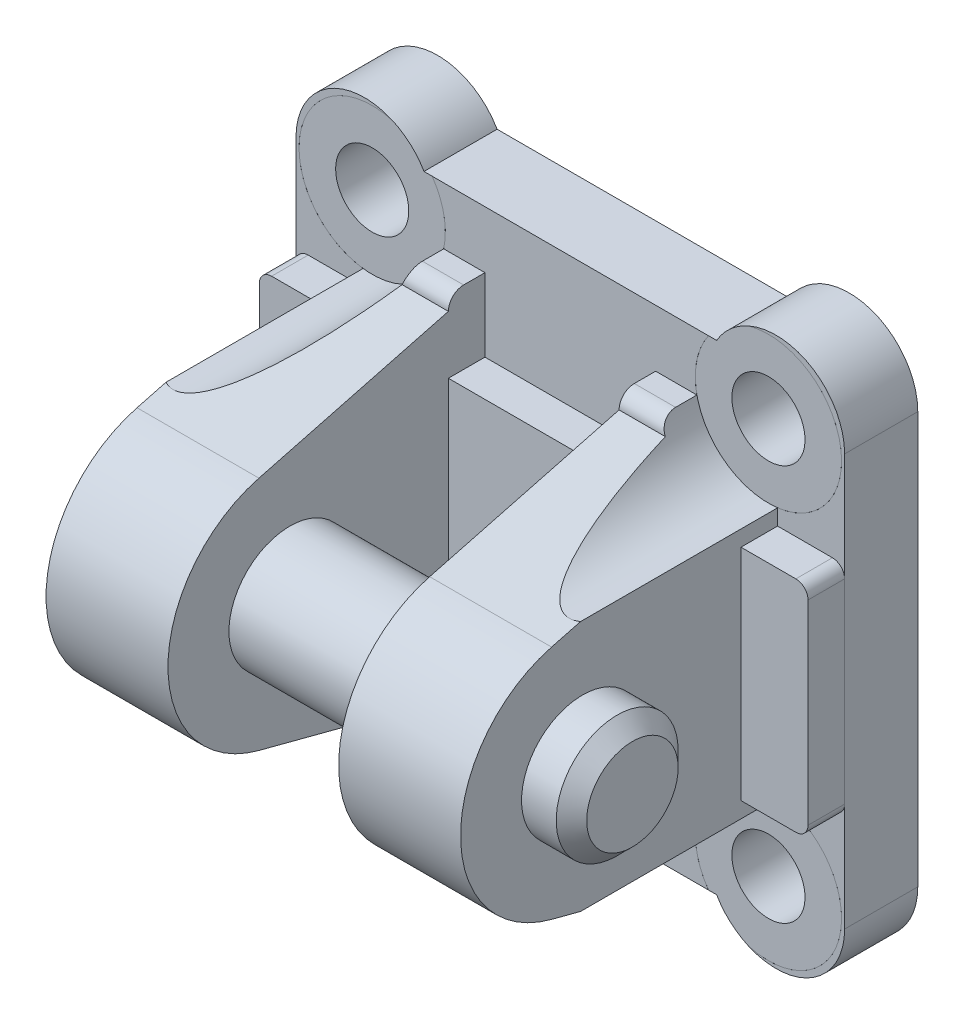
ISO-10303-21;
HEADER;
FILE_DESCRIPTION(('STEP AP214'),'2;1');
FILE_NAME('part.step','',(''),(''),'','','');
FILE_SCHEMA(('AUTOMOTIVE_DESIGN { 1 0 10303 214 1 1 1 1 }'));
ENDSEC;
DATA;
#1=APPLICATION_CONTEXT('core data for automotive mechanical design processes');
#2=APPLICATION_PROTOCOL_DEFINITION('international standard','automotive_design',2000,#1);
#3=PRODUCT_CONTEXT('',#1,'mechanical');
#4=PRODUCT('Part','Part','',(#3));
#5=PRODUCT_RELATED_PRODUCT_CATEGORY('part','',(#4));
#6=PRODUCT_DEFINITION_FORMATION('','',#4);
#7=PRODUCT_DEFINITION_CONTEXT('part definition',#1,'design');
#8=PRODUCT_DEFINITION('design','',#6,#7);
#9=PRODUCT_DEFINITION_SHAPE('','',#8);
#10=(LENGTH_UNIT() NAMED_UNIT(*) SI_UNIT(.MILLI.,.METRE.));
#11=(NAMED_UNIT(*) PLANE_ANGLE_UNIT() SI_UNIT($,.RADIAN.));
#12=(NAMED_UNIT(*) SI_UNIT($,.STERADIAN.) SOLID_ANGLE_UNIT());
#13=UNCERTAINTY_MEASURE_WITH_UNIT(LENGTH_MEASURE(1.E-05),#10,'distance_accuracy_value','');
#14=(GEOMETRIC_REPRESENTATION_CONTEXT(3) GLOBAL_UNCERTAINTY_ASSIGNED_CONTEXT((#13)) GLOBAL_UNIT_ASSIGNED_CONTEXT((#10,
#11,#12)) REPRESENTATION_CONTEXT('',''));
#15=CARTESIAN_POINT('',(0.,0.,0.));
#16=DIRECTION('',(0.,0.,1.));
#17=DIRECTION('',(1.,0.,0.));
#18=AXIS2_PLACEMENT_3D('',#15,#16,#17);
#19=CARTESIAN_POINT('',(-16.8750000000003,16.8750000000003,0.));
#20=DIRECTION('',(0.,0.,1.));
#21=DIRECTION('',(1.,0.,0.));
#22=AXIS2_PLACEMENT_3D('',#19,#20,#21);
#23=PLANE('',#22);
#24=CARTESIAN_POINT('',(-16.8750000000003,16.8750000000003,0.));
#25=DIRECTION('',(0.,0.,1.));
#26=DIRECTION('',(1.,0.,0.));
#27=AXIS2_PLACEMENT_3D('',#24,#25,#26);
#28=CIRCLE('',#27,5.6249999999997);
#29=CARTESIAN_POINT('',(-12.003607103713,19.6875,0.));
#30=VERTEX_POINT('',#29);
#31=CARTESIAN_POINT('',(-22.5,16.875,0.));
#32=VERTEX_POINT('',#31);
#33=EDGE_CURVE('E523',#30,#32,#28,.T.);
#34=ORIENTED_EDGE('',*,*,#33,.F.);
#35=DIRECTION('',(-1.,0.,0.));
#36=VECTOR('',#35,1.);
#37=CARTESIAN_POINT('',(12.003607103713,19.6875,0.));
#38=LINE('',#37,#36);
#39=CARTESIAN_POINT('',(12.003607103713,19.6875,0.));
#40=VERTEX_POINT('',#39);
#41=EDGE_CURVE('E548',#40,#30,#38,.T.);
#42=ORIENTED_EDGE('',*,*,#41,.F.);
#43=CARTESIAN_POINT('',(16.8750000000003,16.8750000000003,0.));
#44=DIRECTION('',(0.,0.,1.));
#45=DIRECTION('',(1.,0.,0.));
#46=AXIS2_PLACEMENT_3D('',#43,#44,#45);
#47=CIRCLE('',#46,5.6249999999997);
#48=CARTESIAN_POINT('',(22.5,16.875,0.));
#49=VERTEX_POINT('',#48);
#50=EDGE_CURVE('E545',#49,#40,#47,.T.);
#51=ORIENTED_EDGE('',*,*,#50,.F.);
#52=DIRECTION('',(0.,1.,0.));
#53=VECTOR('',#52,1.);
#54=CARTESIAN_POINT('',(22.5,-16.875,0.));
#55=LINE('',#54,#53);
#56=CARTESIAN_POINT('',(22.5,-16.875,0.));
#57=VERTEX_POINT('',#56);
#58=EDGE_CURVE('E543',#57,#49,#55,.T.);
#59=ORIENTED_EDGE('',*,*,#58,.F.);
#60=CARTESIAN_POINT('',(16.8750000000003,-16.8750000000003,0.));
#61=DIRECTION('',(0.,0.,1.));
#62=DIRECTION('',(1.,0.,0.));
#63=AXIS2_PLACEMENT_3D('',#60,#61,#62);
#64=CIRCLE('',#63,5.6249999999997);
#65=CARTESIAN_POINT('',(12.003607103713,-19.6875,0.));
#66=VERTEX_POINT('',#65);
#67=EDGE_CURVE('E538',#66,#57,#64,.T.);
#68=ORIENTED_EDGE('',*,*,#67,.F.);
#69=DIRECTION('',(1.,0.,0.));
#70=VECTOR('',#69,1.);
#71=CARTESIAN_POINT('',(-12.003607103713,-19.6875,0.));
#72=LINE('',#71,#70);
#73=CARTESIAN_POINT('',(-12.003607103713,-19.6875,0.));
#74=VERTEX_POINT('',#73);
#75=EDGE_CURVE('E536',#74,#66,#72,.T.);
#76=ORIENTED_EDGE('',*,*,#75,.F.);
#77=CARTESIAN_POINT('',(-16.8750000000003,-16.8750000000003,0.));
#78=DIRECTION('',(0.,0.,1.));
#79=DIRECTION('',(1.,0.,0.));
#80=AXIS2_PLACEMENT_3D('',#77,#78,#79);
#81=CIRCLE('',#80,5.6249999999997);
#82=CARTESIAN_POINT('',(-22.5,-16.875,0.));
#83=VERTEX_POINT('',#82);
#84=EDGE_CURVE('E522',#83,#74,#81,.T.);
#85=ORIENTED_EDGE('',*,*,#84,.F.);
#86=DIRECTION('',(0.,-1.,0.));
#87=VECTOR('',#86,1.);
#88=CARTESIAN_POINT('',(-22.5,16.875,0.));
#89=LINE('',#88,#87);
#90=EDGE_CURVE('E513',#32,#83,#89,.T.);
#91=ORIENTED_EDGE('',*,*,#90,.F.);
#92=EDGE_LOOP('',(#34,#42,#51,#59,#68,#76,#85,#91));
#93=FACE_BOUND('',#92,.T.);
#94=CARTESIAN_POINT('',(16.25,-16.25,0.));
#95=DIRECTION('',(0.,0.,1.));
#96=DIRECTION('',(1.,0.,0.));
#97=AXIS2_PLACEMENT_3D('',#94,#95,#96);
#98=CIRCLE('',#97,3.);
#99=CARTESIAN_POINT('',(19.25,-16.25,0.));
#100=VERTEX_POINT('',#99);
#101=EDGE_CURVE('E595',#100,#100,#98,.T.);
#102=ORIENTED_EDGE('',*,*,#101,.T.);
#103=EDGE_LOOP('',(#102));
#104=FACE_BOUND('',#103,.T.);
#105=CARTESIAN_POINT('',(-16.25,16.25,0.));
#106=DIRECTION('',(0.,0.,1.));
#107=DIRECTION('',(1.,0.,0.));
#108=AXIS2_PLACEMENT_3D('',#105,#106,#107);
#109=CIRCLE('',#108,3.);
#110=CARTESIAN_POINT('',(-13.25,16.25,0.));
#111=VERTEX_POINT('',#110);
#112=EDGE_CURVE('E605',#111,#111,#109,.T.);
#113=ORIENTED_EDGE('',*,*,#112,.T.);
#114=EDGE_LOOP('',(#113));
#115=FACE_BOUND('',#114,.T.);
#116=CARTESIAN_POINT('',(-16.25,-16.25,0.));
#117=DIRECTION('',(0.,0.,1.));
#118=DIRECTION('',(1.,0.,0.));
#119=AXIS2_PLACEMENT_3D('',#116,#117,#118);
#120=CIRCLE('',#119,3.);
#121=CARTESIAN_POINT('',(-13.25,-16.25,0.));
#122=VERTEX_POINT('',#121);
#123=EDGE_CURVE('E615',#122,#122,#120,.T.);
#124=ORIENTED_EDGE('',*,*,#123,.T.);
#125=EDGE_LOOP('',(#124));
#126=FACE_BOUND('',#125,.T.);
#127=CARTESIAN_POINT('',(16.25,16.25,0.));
#128=DIRECTION('',(0.,0.,1.));
#129=DIRECTION('',(1.,0.,0.));
#130=AXIS2_PLACEMENT_3D('',#127,#128,#129);
#131=CIRCLE('',#130,3.);
#132=CARTESIAN_POINT('',(19.25,16.25,0.));
#133=VERTEX_POINT('',#132);
#134=EDGE_CURVE('E380',#133,#133,#131,.T.);
#135=ORIENTED_EDGE('',*,*,#134,.T.);
#136=EDGE_LOOP('',(#135));
#137=FACE_BOUND('',#136,.T.);
#138=CARTESIAN_POINT('',(0.,0.,0.));
#139=DIRECTION('',(0.,0.,1.));
#140=DIRECTION('',(1.,0.,0.));
#141=AXIS2_PLACEMENT_3D('',#138,#139,#140);
#142=CIRCLE('',#141,15.);
#143=CARTESIAN_POINT('',(15.,0.,0.));
#144=VERTEX_POINT('',#143);
#145=EDGE_CURVE('E1527',#144,#144,#142,.T.);
#146=ORIENTED_EDGE('',*,*,#145,.T.);
#147=EDGE_LOOP('',(#146));
#148=FACE_BOUND('',#147,.T.);
#149=ADVANCED_FACE('F31',(#93,#104,#115,#126,#137,#148),#23,.F.);
#150=CARTESIAN_POINT('',(-16.8750000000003,16.8750000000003,6.));
#151=DIRECTION('',(0.,0.,1.));
#152=DIRECTION('',(1.,0.,0.));
#153=AXIS2_PLACEMENT_3D('',#150,#151,#152);
#154=PLANE('',#153);
#155=CARTESIAN_POINT('',(16.25,16.25,6.));
#156=DIRECTION('',(0.,0.,1.));
#157=DIRECTION('',(1.,0.,0.));
#158=AXIS2_PLACEMENT_3D('',#155,#156,#157);
#159=CIRCLE('',#158,6.);
#160=CARTESIAN_POINT('',(11.3323182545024,19.6875,6.));
#161=VERTEX_POINT('',#160);
#162=CARTESIAN_POINT('',(10.3814397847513,15.001,6.));
#163=VERTEX_POINT('',#162);
#164=EDGE_CURVE('E378',#161,#163,#159,.T.);
#165=ORIENTED_EDGE('',*,*,#164,.F.);
#166=DIRECTION('',(-1.,0.,0.));
#167=VECTOR('',#166,1.);
#168=CARTESIAN_POINT('',(12.003607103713,19.6875,6.));
#169=LINE('',#168,#167);
#170=CARTESIAN_POINT('',(-11.3323182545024,19.6875,6.));
#171=VERTEX_POINT('',#170);
#172=EDGE_CURVE('E377',#161,#171,#169,.T.);
#173=ORIENTED_EDGE('',*,*,#172,.T.);
#174=CARTESIAN_POINT('',(-16.25,16.25,6.));
#175=DIRECTION('',(0.,0.,1.));
#176=DIRECTION('',(1.,0.,0.));
#177=AXIS2_PLACEMENT_3D('',#174,#175,#176);
#178=CIRCLE('',#177,6.);
#179=CARTESIAN_POINT('',(-10.3814397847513,15.001,6.));
#180=VERTEX_POINT('',#179);
#181=EDGE_CURVE('E1564',#180,#171,#178,.T.);
#182=ORIENTED_EDGE('',*,*,#181,.F.);
#183=DIRECTION('',(-1.,0.,0.));
#184=VECTOR('',#183,1.);
#185=CARTESIAN_POINT('',(-16.8750000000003,15.001,6.));
#186=LINE('',#185,#184);
#187=CARTESIAN_POINT('',(-7.,15.001,6.));
#188=VERTEX_POINT('',#187);
#189=EDGE_CURVE('E786',#188,#180,#186,.T.);
#190=ORIENTED_EDGE('',*,*,#189,.F.);
#191=DIRECTION('',(0.,1.,0.));
#192=VECTOR('',#191,1.);
#193=CARTESIAN_POINT('',(-7.,16.8750000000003,6.));
#194=LINE('',#193,#192);
#195=CARTESIAN_POINT('',(-7.,9.,6.));
#196=VERTEX_POINT('',#195);
#197=EDGE_CURVE('E909',#196,#188,#194,.T.);
#198=ORIENTED_EDGE('',*,*,#197,.F.);
#199=DIRECTION('',(1.,0.,0.));
#200=VECTOR('',#199,1.);
#201=CARTESIAN_POINT('',(-16.8750000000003,9.,6.));
#202=LINE('',#201,#200);
#203=CARTESIAN_POINT('',(7.,9.,6.));
#204=VERTEX_POINT('',#203);
#205=EDGE_CURVE('E971',#196,#204,#202,.T.);
#206=ORIENTED_EDGE('',*,*,#205,.T.);
#207=DIRECTION('',(0.,1.,0.));
#208=VECTOR('',#207,1.);
#209=CARTESIAN_POINT('',(7.,16.8750000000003,6.));
#210=LINE('',#209,#208);
#211=CARTESIAN_POINT('',(7.,15.001,6.));
#212=VERTEX_POINT('',#211);
#213=EDGE_CURVE('E837',#204,#212,#210,.T.);
#214=ORIENTED_EDGE('',*,*,#213,.T.);
#215=DIRECTION('',(1.,0.,0.));
#216=VECTOR('',#215,1.);
#217=CARTESIAN_POINT('',(-16.8750000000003,15.001,6.));
#218=LINE('',#217,#216);
#219=EDGE_CURVE('E844',#212,#163,#218,.T.);
#220=ORIENTED_EDGE('',*,*,#219,.T.);
#221=EDGE_LOOP('',(#165,#173,#182,#190,#198,#206,#214,#220));
#222=FACE_BOUND('',#221,.T.);
#223=ADVANCED_FACE('F462',(#222),#154,.T.);
#224=CARTESIAN_POINT('',(-16.25,-16.25,6.));
#225=DIRECTION('',(0.,0.,1.));
#226=DIRECTION('',(1.,0.,0.));
#227=AXIS2_PLACEMENT_3D('',#224,#225,#226);
#228=CIRCLE('',#227,6.);
#229=CARTESIAN_POINT('',(-17.,-10.2970595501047,6.));
#230=VERTEX_POINT('',#229);
#231=CARTESIAN_POINT('',(-14.595207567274,-22.0172924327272,6.));
#232=VERTEX_POINT('',#231);
#233=EDGE_CURVE('E873',#230,#232,#228,.T.);
#234=ORIENTED_EDGE('',*,*,#233,.F.);
#235=DIRECTION('',(0.,1.,0.));
#236=VECTOR('',#235,1.);
#237=CARTESIAN_POINT('',(-17.,16.8750000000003,6.));
#238=LINE('',#237,#236);
#239=CARTESIAN_POINT('',(-17.,-9.,6.));
#240=VERTEX_POINT('',#239);
#241=EDGE_CURVE('E772',#230,#240,#238,.T.);
#242=ORIENTED_EDGE('',*,*,#241,.T.);
#243=DIRECTION('',(-1.,0.,0.));
#244=VECTOR('',#243,1.);
#245=CARTESIAN_POINT('',(-16.8750000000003,-9.,6.));
#246=LINE('',#245,#244);
#247=CARTESIAN_POINT('',(-21.499,-9.,6.));
#248=VERTEX_POINT('',#247);
#249=EDGE_CURVE('E955',#240,#248,#246,.T.);
#250=ORIENTED_EDGE('',*,*,#249,.T.);
#251=CARTESIAN_POINT('',(-21.4990000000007,-8.00000000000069,6.));
#252=DIRECTION('',(0.,0.,1.));
#253=DIRECTION('',(1.,0.,0.));
#254=AXIS2_PLACEMENT_3D('',#251,#252,#253);
#255=CIRCLE('',#254,0.99999999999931);
#256=CARTESIAN_POINT('',(-22.499,-8.,6.));
#257=VERTEX_POINT('',#256);
#258=EDGE_CURVE('E943',#248,#257,#255,.F.);
#259=ORIENTED_EDGE('',*,*,#258,.T.);
#260=DIRECTION('',(0.,1.,0.));
#261=VECTOR('',#260,1.);
#262=CARTESIAN_POINT('',(-22.499,16.8750000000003,6.));
#263=LINE('',#262,#261);
#264=CARTESIAN_POINT('',(-22.499,8.,6.));
#265=VERTEX_POINT('',#264);
#266=EDGE_CURVE('E940',#257,#265,#263,.T.);
#267=ORIENTED_EDGE('',*,*,#266,.T.);
#268=CARTESIAN_POINT('',(-21.4990000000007,8.00000000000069,6.));
#269=DIRECTION('',(0.,0.,1.));
#270=DIRECTION('',(1.,0.,0.));
#271=AXIS2_PLACEMENT_3D('',#268,#269,#270);
#272=CIRCLE('',#271,0.99999999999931);
#273=CARTESIAN_POINT('',(-21.499,9.,6.));
#274=VERTEX_POINT('',#273);
#275=EDGE_CURVE('E937',#265,#274,#272,.F.);
#276=ORIENTED_EDGE('',*,*,#275,.T.);
#277=CARTESIAN_POINT('',(-17.,9.,6.));
#278=VERTEX_POINT('',#277);
#279=EDGE_CURVE('E965',#274,#278,#202,.T.);
#280=ORIENTED_EDGE('',*,*,#279,.T.);
#281=CARTESIAN_POINT('',(-17.,10.2970595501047,6.));
#282=VERTEX_POINT('',#281);
#283=EDGE_CURVE('E784',#278,#282,#238,.T.);
#284=ORIENTED_EDGE('',*,*,#283,.T.);
#285=CARTESIAN_POINT('',(-14.595207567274,22.0172924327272,6.));
#286=VERTEX_POINT('',#285);
#287=EDGE_CURVE('E1569',#286,#282,#178,.T.);
#288=ORIENTED_EDGE('',*,*,#287,.F.);
#289=CARTESIAN_POINT('',(-16.8750000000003,16.8750000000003,6.));
#290=DIRECTION('',(0.,0.,1.));
#291=DIRECTION('',(1.,0.,0.));
#292=AXIS2_PLACEMENT_3D('',#289,#290,#291);
#293=CIRCLE('',#292,5.6249999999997);
#294=CARTESIAN_POINT('',(-22.5,16.875,6.));
#295=VERTEX_POINT('',#294);
#296=EDGE_CURVE('E551',#286,#295,#293,.T.);
#297=ORIENTED_EDGE('',*,*,#296,.T.);
#298=DIRECTION('',(0.,-1.,0.));
#299=VECTOR('',#298,1.);
#300=CARTESIAN_POINT('',(-22.5,16.875,6.));
#301=LINE('',#300,#299);
#302=CARTESIAN_POINT('',(-22.5,-16.875,6.));
#303=VERTEX_POINT('',#302);
#304=EDGE_CURVE('E553',#295,#303,#301,.T.);
#305=ORIENTED_EDGE('',*,*,#304,.T.);
#306=CARTESIAN_POINT('',(-16.8750000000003,-16.8750000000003,6.));
#307=DIRECTION('',(0.,0.,1.));
#308=DIRECTION('',(1.,0.,0.));
#309=AXIS2_PLACEMENT_3D('',#306,#307,#308);
#310=CIRCLE('',#309,5.6249999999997);
#311=EDGE_CURVE('E531',#303,#232,#310,.T.);
#312=ORIENTED_EDGE('',*,*,#311,.T.);
#313=EDGE_LOOP('',(#234,#242,#250,#259,#267,#276,#280,#284,#288,#297,#305,#312));
#314=FACE_BOUND('',#313,.T.);
#315=ADVANCED_FACE('F468',(#314),#154,.T.);
#316=CARTESIAN_POINT('',(-11.3323182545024,-19.6875,6.));
#317=VERTEX_POINT('',#316);
#318=CARTESIAN_POINT('',(-10.3818657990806,-14.999,6.));
#319=VERTEX_POINT('',#318);
#320=EDGE_CURVE('E874',#317,#319,#228,.T.);
#321=ORIENTED_EDGE('',*,*,#320,.F.);
#322=DIRECTION('',(1.,0.,0.));
#323=VECTOR('',#322,1.);
#324=CARTESIAN_POINT('',(-12.003607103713,-19.6875,6.));
#325=LINE('',#324,#323);
#326=CARTESIAN_POINT('',(11.3323182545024,-19.6875,6.));
#327=VERTEX_POINT('',#326);
#328=EDGE_CURVE('E556',#317,#327,#325,.T.);
#329=ORIENTED_EDGE('',*,*,#328,.T.);
#330=CARTESIAN_POINT('',(16.25,-16.25,6.));
#331=DIRECTION('',(0.,0.,1.));
#332=DIRECTION('',(1.,0.,0.));
#333=AXIS2_PLACEMENT_3D('',#330,#331,#332);
#334=CIRCLE('',#333,6.);
#335=CARTESIAN_POINT('',(10.3818657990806,-14.999,6.));
#336=VERTEX_POINT('',#335);
#337=EDGE_CURVE('E1049',#336,#327,#334,.T.);
#338=ORIENTED_EDGE('',*,*,#337,.F.);
#339=DIRECTION('',(-1.,0.,0.));
#340=VECTOR('',#339,1.);
#341=CARTESIAN_POINT('',(-16.8750000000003,-14.999,6.));
#342=LINE('',#341,#340);
#343=CARTESIAN_POINT('',(7.,-14.999,6.));
#344=VERTEX_POINT('',#343);
#345=EDGE_CURVE('E847',#336,#344,#342,.T.);
#346=ORIENTED_EDGE('',*,*,#345,.T.);
#347=CARTESIAN_POINT('',(7.,-9.,6.));
#348=VERTEX_POINT('',#347);
#349=EDGE_CURVE('E838',#344,#348,#210,.T.);
#350=ORIENTED_EDGE('',*,*,#349,.T.);
#351=CARTESIAN_POINT('',(-7.,-9.,6.));
#352=VERTEX_POINT('',#351);
#353=EDGE_CURVE('E960',#348,#352,#246,.T.);
#354=ORIENTED_EDGE('',*,*,#353,.T.);
#355=CARTESIAN_POINT('',(-7.,-14.999,6.));
#356=VERTEX_POINT('',#355);
#357=EDGE_CURVE('E789',#356,#352,#194,.T.);
#358=ORIENTED_EDGE('',*,*,#357,.F.);
#359=DIRECTION('',(1.,0.,0.));
#360=VECTOR('',#359,1.);
#361=CARTESIAN_POINT('',(-16.8750000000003,-14.999,6.));
#362=LINE('',#361,#360);
#363=EDGE_CURVE('E783',#319,#356,#362,.T.);
#364=ORIENTED_EDGE('',*,*,#363,.F.);
#365=EDGE_LOOP('',(#321,#329,#338,#346,#350,#354,#358,#364));
#366=FACE_BOUND('',#365,.T.);
#367=ADVANCED_FACE('F480',(#366),#154,.T.);
#368=CARTESIAN_POINT('',(17.,10.2970595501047,6.));
#369=VERTEX_POINT('',#368);
#370=CARTESIAN_POINT('',(14.595207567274,22.0172924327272,6.));
#371=VERTEX_POINT('',#370);
#372=EDGE_CURVE('E382',#369,#371,#159,.T.);
#373=ORIENTED_EDGE('',*,*,#372,.F.);
#374=DIRECTION('',(0.,1.,0.));
#375=VECTOR('',#374,1.);
#376=CARTESIAN_POINT('',(17.,16.8750000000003,6.));
#377=LINE('',#376,#375);
#378=CARTESIAN_POINT('',(17.,9.,6.));
#379=VERTEX_POINT('',#378);
#380=EDGE_CURVE('E841',#379,#369,#377,.T.);
#381=ORIENTED_EDGE('',*,*,#380,.F.);
#382=CARTESIAN_POINT('',(21.499,9.,6.));
#383=VERTEX_POINT('',#382);
#384=EDGE_CURVE('E962',#379,#383,#202,.T.);
#385=ORIENTED_EDGE('',*,*,#384,.T.);
#386=CARTESIAN_POINT('',(21.4990000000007,8.00000000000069,6.));
#387=DIRECTION('',(0.,0.,1.));
#388=DIRECTION('',(1.,0.,0.));
#389=AXIS2_PLACEMENT_3D('',#386,#387,#388);
#390=CIRCLE('',#389,0.99999999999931);
#391=CARTESIAN_POINT('',(22.499,8.00000000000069,6.));
#392=VERTEX_POINT('',#391);
#393=EDGE_CURVE('E950',#383,#392,#390,.F.);
#394=ORIENTED_EDGE('',*,*,#393,.T.);
#395=DIRECTION('',(0.,-1.,0.));
#396=VECTOR('',#395,1.);
#397=CARTESIAN_POINT('',(22.499,16.8750000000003,6.));
#398=LINE('',#397,#396);
#399=CARTESIAN_POINT('',(22.499,-8.,6.));
#400=VERTEX_POINT('',#399);
#401=EDGE_CURVE('E948',#392,#400,#398,.T.);
#402=ORIENTED_EDGE('',*,*,#401,.T.);
#403=CARTESIAN_POINT('',(21.4990000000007,-8.00000000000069,6.));
#404=DIRECTION('',(0.,0.,1.));
#405=DIRECTION('',(1.,0.,0.));
#406=AXIS2_PLACEMENT_3D('',#403,#404,#405);
#407=CIRCLE('',#406,0.99999999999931);
#408=CARTESIAN_POINT('',(21.499,-9.,6.));
#409=VERTEX_POINT('',#408);
#410=EDGE_CURVE('E946',#400,#409,#407,.F.);
#411=ORIENTED_EDGE('',*,*,#410,.T.);
#412=CARTESIAN_POINT('',(17.,-9.,6.));
#413=VERTEX_POINT('',#412);
#414=EDGE_CURVE('E952',#409,#413,#246,.T.);
#415=ORIENTED_EDGE('',*,*,#414,.T.);
#416=CARTESIAN_POINT('',(17.,-10.2970595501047,6.));
#417=VERTEX_POINT('',#416);
#418=EDGE_CURVE('E842',#417,#413,#377,.T.);
#419=ORIENTED_EDGE('',*,*,#418,.F.);
#420=CARTESIAN_POINT('',(14.5952075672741,-22.0172924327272,6.));
#421=VERTEX_POINT('',#420);
#422=EDGE_CURVE('E1050',#421,#417,#334,.T.);
#423=ORIENTED_EDGE('',*,*,#422,.F.);
#424=CARTESIAN_POINT('',(16.8750000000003,-16.8750000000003,6.));
#425=DIRECTION('',(0.,0.,1.));
#426=DIRECTION('',(1.,0.,0.));
#427=AXIS2_PLACEMENT_3D('',#424,#425,#426);
#428=CIRCLE('',#427,5.6249999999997);
#429=CARTESIAN_POINT('',(22.5,-16.875,6.));
#430=VERTEX_POINT('',#429);
#431=EDGE_CURVE('E558',#421,#430,#428,.T.);
#432=ORIENTED_EDGE('',*,*,#431,.T.);
#433=DIRECTION('',(0.,1.,0.));
#434=VECTOR('',#433,1.);
#435=CARTESIAN_POINT('',(22.5,-16.875,6.));
#436=LINE('',#435,#434);
#437=CARTESIAN_POINT('',(22.5,16.875,6.));
#438=VERTEX_POINT('',#437);
#439=EDGE_CURVE('E560',#430,#438,#436,.T.);
#440=ORIENTED_EDGE('',*,*,#439,.T.);
#441=CARTESIAN_POINT('',(16.8750000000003,16.8750000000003,6.));
#442=DIRECTION('',(0.,0.,1.));
#443=DIRECTION('',(1.,0.,0.));
#444=AXIS2_PLACEMENT_3D('',#441,#442,#443);
#445=CIRCLE('',#444,5.6249999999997);
#446=EDGE_CURVE('E562',#438,#371,#445,.T.);
#447=ORIENTED_EDGE('',*,*,#446,.T.);
#448=EDGE_LOOP('',(#373,#381,#385,#394,#402,#411,#415,#419,#423,#432,#440,#447));
#449=FACE_BOUND('',#448,.T.);
#450=ADVANCED_FACE('F471',(#449),#154,.T.);
#451=CARTESIAN_POINT('',(17.,0.001000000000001,21.9990000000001));
#452=DIRECTION('',(1.,0.,0.));
#453=DIRECTION('',(0.,0.,-1.));
#454=AXIS2_PLACEMENT_3D('',#451,#452,#453);
#455=PLANE('',#454);
#456=DIRECTION('',(0.,0.,-1.));
#457=VECTOR('',#456,1.);
#458=CARTESIAN_POINT('',(17.,10.2970595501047,-0.001000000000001));
#459=LINE('',#458,#457);
#460=CARTESIAN_POINT('',(17.,10.2970595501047,22.161191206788));
#461=VERTEX_POINT('',#460);
#462=EDGE_CURVE('E1107',#461,#369,#459,.T.);
#463=ORIENTED_EDGE('',*,*,#462,.F.);
#464=DIRECTION('',(0.,-0.253838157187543,0.967246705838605));
#465=VECTOR('',#464,1.);
#466=CARTESIAN_POINT('',(17.,13.751,9.));
#467=LINE('',#466,#465);
#468=CARTESIAN_POINT('',(17.,9.6734670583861,24.537381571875));
#469=VERTEX_POINT('',#468);
#470=EDGE_CURVE('E821',#461,#469,#467,.T.);
#471=ORIENTED_EDGE('',*,*,#470,.T.);
#472=CARTESIAN_POINT('',(17.,0.001000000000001,21.9990000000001));
#473=DIRECTION('',(1.,0.,0.));
#474=DIRECTION('',(0.,0.,-1.));
#475=AXIS2_PLACEMENT_3D('',#472,#473,#474);
#476=CIRCLE('',#475,9.99999999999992);
#477=CARTESIAN_POINT('',(17.,-9.6714670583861,24.537381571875));
#478=VERTEX_POINT('',#477);
#479=EDGE_CURVE('E815',#469,#478,#476,.T.);
#480=ORIENTED_EDGE('',*,*,#479,.T.);
#481=DIRECTION('',(0.,-0.253838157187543,-0.967246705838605));
#482=VECTOR('',#481,1.);
#483=CARTESIAN_POINT('',(17.,-9.6714670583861,24.537381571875));
#484=LINE('',#483,#482);
#485=CARTESIAN_POINT('',(17.,-10.2970595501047,22.1535702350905));
#486=VERTEX_POINT('',#485);
#487=EDGE_CURVE('E818',#478,#486,#484,.T.);
#488=ORIENTED_EDGE('',*,*,#487,.T.);
#489=DIRECTION('',(0.,0.,-1.));
#490=VECTOR('',#489,1.);
#491=CARTESIAN_POINT('',(17.,-10.2970595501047,-0.000999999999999));
#492=LINE('',#491,#490);
#493=EDGE_CURVE('E1051',#417,#486,#492,.F.);
#494=ORIENTED_EDGE('',*,*,#493,.F.);
#495=ORIENTED_EDGE('',*,*,#418,.T.);
#496=DIRECTION('',(0.,0.,1.));
#497=VECTOR('',#496,1.);
#498=CARTESIAN_POINT('',(17.,-9.,21.9990000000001));
#499=LINE('',#498,#497);
#500=CARTESIAN_POINT('',(17.,-9.,9.));
#501=VERTEX_POINT('',#500);
#502=EDGE_CURVE('E953',#413,#501,#499,.T.);
#503=ORIENTED_EDGE('',*,*,#502,.T.);
#504=DIRECTION('',(0.,-1.,0.));
#505=VECTOR('',#504,1.);
#506=CARTESIAN_POINT('',(17.,0.001000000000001,9.));
#507=LINE('',#506,#505);
#508=CARTESIAN_POINT('',(17.,9.,9.));
#509=VERTEX_POINT('',#508);
#510=EDGE_CURVE('E973',#509,#501,#507,.T.);
#511=ORIENTED_EDGE('',*,*,#510,.F.);
#512=DIRECTION('',(0.,0.,-1.));
#513=VECTOR('',#512,1.);
#514=CARTESIAN_POINT('',(17.,9.,21.9990000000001));
#515=LINE('',#514,#513);
#516=EDGE_CURVE('E963',#509,#379,#515,.T.);
#517=ORIENTED_EDGE('',*,*,#516,.T.);
#518=ORIENTED_EDGE('',*,*,#380,.T.);
#519=EDGE_LOOP('',(#463,#471,#480,#488,#494,#495,#503,#511,#517,#518));
#520=FACE_BOUND('',#519,.T.);
#521=CARTESIAN_POINT('',(17.,0.,22.));
#522=DIRECTION('',(1.,0.,0.));
#523=DIRECTION('',(0.,0.,-1.));
#524=AXIS2_PLACEMENT_3D('',#521,#522,#523);
#525=CIRCLE('',#524,5.);
#526=CARTESIAN_POINT('',(17.,0.,17.));
#527=VERTEX_POINT('',#526);
#528=EDGE_CURVE('E590',#527,#527,#525,.T.);
#529=ORIENTED_EDGE('',*,*,#528,.F.);
#530=EDGE_LOOP('',(#529));
#531=FACE_BOUND('',#530,.T.);
#532=ADVANCED_FACE('F479',(#520,#531),#455,.T.);
#533=CARTESIAN_POINT('',(7.,0.001000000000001,21.9990000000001));
#534=DIRECTION('',(1.,0.,0.));
#535=DIRECTION('',(0.,0.,-1.));
#536=AXIS2_PLACEMENT_3D('',#533,#534,#535);
#537=PLANE('',#536);
#538=CARTESIAN_POINT('',(7.,0.,22.));
#539=DIRECTION('',(1.,0.,0.));
#540=DIRECTION('',(0.,0.,-1.));
#541=AXIS2_PLACEMENT_3D('',#538,#539,#540);
#542=CIRCLE('',#541,5.);
#543=CARTESIAN_POINT('',(7.,0.,17.));
#544=VERTEX_POINT('',#543);
#545=EDGE_CURVE('E1026',#544,#544,#542,.T.);
#546=ORIENTED_EDGE('',*,*,#545,.T.);
#547=EDGE_LOOP('',(#546));
#548=FACE_BOUND('',#547,.T.);
#549=DIRECTION('',(0.,0.,1.));
#550=VECTOR('',#549,1.);
#551=CARTESIAN_POINT('',(7.,-9.,21.9990000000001));
#552=LINE('',#551,#550);
#553=CARTESIAN_POINT('',(7.,-9.,9.));
#554=VERTEX_POINT('',#553);
#555=EDGE_CURVE('E957',#348,#554,#552,.T.);
#556=ORIENTED_EDGE('',*,*,#555,.F.);
#557=ORIENTED_EDGE('',*,*,#349,.F.);
#558=DIRECTION('',(0.,0.,-1.));
#559=VECTOR('',#558,1.);
#560=CARTESIAN_POINT('',(7.,-14.999,7.75));
#561=LINE('',#560,#559);
#562=CARTESIAN_POINT('',(7.,-14.999,7.75));
#563=VERTEX_POINT('',#562);
#564=EDGE_CURVE('E804',#563,#344,#561,.T.);
#565=ORIENTED_EDGE('',*,*,#564,.F.);
#566=CARTESIAN_POINT('',(7.,-13.7489999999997,7.74999999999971));
#567=DIRECTION('',(1.,0.,0.));
#568=DIRECTION('',(0.,0.,-1.));
#569=AXIS2_PLACEMENT_3D('',#566,#567,#568);
#570=CIRCLE('',#569,1.25000000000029);
#571=CARTESIAN_POINT('',(7.,-13.749,9.));
#572=VERTEX_POINT('',#571);
#573=EDGE_CURVE('E801',#572,#563,#570,.T.);
#574=ORIENTED_EDGE('',*,*,#573,.F.);
#575=DIRECTION('',(0.,-0.253838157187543,-0.967246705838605));
#576=VECTOR('',#575,1.);
#577=CARTESIAN_POINT('',(7.,-9.6714670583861,24.537381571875));
#578=LINE('',#577,#576);
#579=CARTESIAN_POINT('',(7.,-9.6714670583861,24.537381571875));
#580=VERTEX_POINT('',#579);
#581=EDGE_CURVE('E798',#580,#572,#578,.T.);
#582=ORIENTED_EDGE('',*,*,#581,.F.);
#583=CARTESIAN_POINT('',(7.,0.001000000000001,21.9990000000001));
#584=DIRECTION('',(1.,0.,0.));
#585=DIRECTION('',(0.,0.,-1.));
#586=AXIS2_PLACEMENT_3D('',#583,#584,#585);
#587=CIRCLE('',#586,9.99999999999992);
#588=CARTESIAN_POINT('',(7.,9.6734670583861,24.537381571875));
#589=VERTEX_POINT('',#588);
#590=EDGE_CURVE('E795',#589,#580,#587,.T.);
#591=ORIENTED_EDGE('',*,*,#590,.F.);
#592=DIRECTION('',(0.,-0.253838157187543,0.967246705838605));
#593=VECTOR('',#592,1.);
#594=CARTESIAN_POINT('',(7.,13.751,9.));
#595=LINE('',#594,#593);
#596=CARTESIAN_POINT('',(7.,13.751,9.));
#597=VERTEX_POINT('',#596);
#598=EDGE_CURVE('E813',#597,#589,#595,.T.);
#599=ORIENTED_EDGE('',*,*,#598,.F.);
#600=CARTESIAN_POINT('',(7.,13.7509999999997,7.74999999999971));
#601=DIRECTION('',(1.,0.,0.));
#602=DIRECTION('',(0.,0.,-1.));
#603=AXIS2_PLACEMENT_3D('',#600,#601,#602);
#604=CIRCLE('',#603,1.25000000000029);
#605=CARTESIAN_POINT('',(7.,15.001,7.75));
#606=VERTEX_POINT('',#605);
#607=EDGE_CURVE('E810',#606,#597,#604,.T.);
#608=ORIENTED_EDGE('',*,*,#607,.F.);
#609=DIRECTION('',(0.,0.,1.));
#610=VECTOR('',#609,1.);
#611=CARTESIAN_POINT('',(7.,15.001,0.));
#612=LINE('',#611,#610);
#613=EDGE_CURVE('E807',#212,#606,#612,.T.);
#614=ORIENTED_EDGE('',*,*,#613,.F.);
#615=ORIENTED_EDGE('',*,*,#213,.F.);
#616=DIRECTION('',(0.,0.,-1.));
#617=VECTOR('',#616,1.);
#618=CARTESIAN_POINT('',(7.,9.,21.9990000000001));
#619=LINE('',#618,#617);
#620=CARTESIAN_POINT('',(7.,9.,9.));
#621=VERTEX_POINT('',#620);
#622=EDGE_CURVE('E968',#621,#204,#619,.T.);
#623=ORIENTED_EDGE('',*,*,#622,.F.);
#624=DIRECTION('',(0.,-1.,0.));
#625=VECTOR('',#624,1.);
#626=CARTESIAN_POINT('',(7.,0.001000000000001,9.));
#627=LINE('',#626,#625);
#628=EDGE_CURVE('E976',#621,#554,#627,.T.);
#629=ORIENTED_EDGE('',*,*,#628,.T.);
#630=EDGE_LOOP('',(#556,#557,#565,#574,#582,#591,#599,#608,#614,#615,#623,#629));
#631=FACE_BOUND('',#630,.T.);
#632=ADVANCED_FACE('F758',(#548,#631),#537,.F.);
#633=CARTESIAN_POINT('',(-17.,0.001000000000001,21.9990000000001));
#634=DIRECTION('',(1.,0.,0.));
#635=DIRECTION('',(0.,0.,-1.));
#636=AXIS2_PLACEMENT_3D('',#633,#634,#635);
#637=PLANE('',#636);
#638=CARTESIAN_POINT('',(-17.,0.,22.));
#639=DIRECTION('',(1.,0.,0.));
#640=DIRECTION('',(0.,0.,-1.));
#641=AXIS2_PLACEMENT_3D('',#638,#639,#640);
#642=CIRCLE('',#641,5.);
#643=CARTESIAN_POINT('',(-17.,0.,17.));
#644=VERTEX_POINT('',#643);
#645=EDGE_CURVE('E768',#644,#644,#642,.T.);
#646=ORIENTED_EDGE('',*,*,#645,.T.);
#647=EDGE_LOOP('',(#646));
#648=FACE_BOUND('',#647,.T.);
#649=ORIENTED_EDGE('',*,*,#241,.F.);
#650=DIRECTION('',(0.,0.,-1.));
#651=VECTOR('',#650,1.);
#652=CARTESIAN_POINT('',(-17.,-10.2970595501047,-0.000999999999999));
#653=LINE('',#652,#651);
#654=CARTESIAN_POINT('',(-17.,-10.2970595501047,22.1535702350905));
#655=VERTEX_POINT('',#654);
#656=EDGE_CURVE('E774',#230,#655,#653,.F.);
#657=ORIENTED_EDGE('',*,*,#656,.T.);
#658=DIRECTION('',(0.,-0.253838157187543,-0.967246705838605));
#659=VECTOR('',#658,1.);
#660=CARTESIAN_POINT('',(-17.,-9.6714670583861,24.537381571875));
#661=LINE('',#660,#659);
#662=CARTESIAN_POINT('',(-17.,-9.6714670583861,24.537381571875));
#663=VERTEX_POINT('',#662);
#664=EDGE_CURVE('E898',#663,#655,#661,.T.);
#665=ORIENTED_EDGE('',*,*,#664,.F.);
#666=CARTESIAN_POINT('',(-17.,0.001000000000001,21.9990000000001));
#667=DIRECTION('',(1.,0.,0.));
#668=DIRECTION('',(0.,0.,-1.));
#669=AXIS2_PLACEMENT_3D('',#666,#667,#668);
#670=CIRCLE('',#669,9.99999999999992);
#671=CARTESIAN_POINT('',(-17.,9.6734670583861,24.537381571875));
#672=VERTEX_POINT('',#671);
#673=EDGE_CURVE('E904',#672,#663,#670,.T.);
#674=ORIENTED_EDGE('',*,*,#673,.F.);
#675=DIRECTION('',(0.,-0.253838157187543,0.967246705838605));
#676=VECTOR('',#675,1.);
#677=CARTESIAN_POINT('',(-17.,13.751,9.));
#678=LINE('',#677,#676);
#679=CARTESIAN_POINT('',(-17.,10.2970595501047,22.161191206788));
#680=VERTEX_POINT('',#679);
#681=EDGE_CURVE('E893',#680,#672,#678,.T.);
#682=ORIENTED_EDGE('',*,*,#681,.F.);
#683=DIRECTION('',(0.,0.,-1.));
#684=VECTOR('',#683,1.);
#685=CARTESIAN_POINT('',(-17.,10.2970595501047,-0.001000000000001));
#686=LINE('',#685,#684);
#687=EDGE_CURVE('E1567',#680,#282,#686,.T.);
#688=ORIENTED_EDGE('',*,*,#687,.T.);
#689=ORIENTED_EDGE('',*,*,#283,.F.);
#690=DIRECTION('',(0.,0.,-1.));
#691=VECTOR('',#690,1.);
#692=CARTESIAN_POINT('',(-17.,9.,21.9990000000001));
#693=LINE('',#692,#691);
#694=CARTESIAN_POINT('',(-17.,9.,9.));
#695=VERTEX_POINT('',#694);
#696=EDGE_CURVE('E966',#695,#278,#693,.T.);
#697=ORIENTED_EDGE('',*,*,#696,.F.);
#698=DIRECTION('',(0.,-1.,0.));
#699=VECTOR('',#698,1.);
#700=CARTESIAN_POINT('',(-17.,0.001000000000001,9.));
#701=LINE('',#700,#699);
#702=CARTESIAN_POINT('',(-17.,-9.,9.));
#703=VERTEX_POINT('',#702);
#704=EDGE_CURVE('E978',#695,#703,#701,.T.);
#705=ORIENTED_EDGE('',*,*,#704,.T.);
#706=DIRECTION('',(0.,0.,1.));
#707=VECTOR('',#706,1.);
#708=CARTESIAN_POINT('',(-17.,-9.,21.9990000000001));
#709=LINE('',#708,#707);
#710=EDGE_CURVE('E778',#240,#703,#709,.T.);
#711=ORIENTED_EDGE('',*,*,#710,.F.);
#712=EDGE_LOOP('',(#649,#657,#665,#674,#682,#688,#689,#697,#705,#711));
#713=FACE_BOUND('',#712,.T.);
#714=ADVANCED_FACE('F755',(#648,#713),#637,.F.);
#715=CARTESIAN_POINT('',(-7.,0.001000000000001,21.9990000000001));
#716=DIRECTION('',(1.,0.,0.));
#717=DIRECTION('',(0.,0.,-1.));
#718=AXIS2_PLACEMENT_3D('',#715,#716,#717);
#719=PLANE('',#718);
#720=CARTESIAN_POINT('',(-7.,0.,22.));
#721=DIRECTION('',(1.,0.,0.));
#722=DIRECTION('',(0.,0.,-1.));
#723=AXIS2_PLACEMENT_3D('',#720,#721,#722);
#724=CIRCLE('',#723,5.);
#725=CARTESIAN_POINT('',(-7.,0.,17.));
#726=VERTEX_POINT('',#725);
#727=EDGE_CURVE('E587',#726,#726,#724,.T.);
#728=ORIENTED_EDGE('',*,*,#727,.F.);
#729=EDGE_LOOP('',(#728));
#730=FACE_BOUND('',#729,.T.);
#731=ORIENTED_EDGE('',*,*,#357,.T.);
#732=DIRECTION('',(0.,0.,1.));
#733=VECTOR('',#732,1.);
#734=CARTESIAN_POINT('',(-7.,-9.,21.9990000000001));
#735=LINE('',#734,#733);
#736=CARTESIAN_POINT('',(-7.,-9.,9.));
#737=VERTEX_POINT('',#736);
#738=EDGE_CURVE('E585',#352,#737,#735,.T.);
#739=ORIENTED_EDGE('',*,*,#738,.T.);
#740=DIRECTION('',(0.,-1.,0.));
#741=VECTOR('',#740,1.);
#742=CARTESIAN_POINT('',(-7.,0.001000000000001,9.));
#743=LINE('',#742,#741);
#744=CARTESIAN_POINT('',(-7.,9.,9.));
#745=VERTEX_POINT('',#744);
#746=EDGE_CURVE('E580',#745,#737,#743,.T.);
#747=ORIENTED_EDGE('',*,*,#746,.F.);
#748=DIRECTION('',(0.,0.,-1.));
#749=VECTOR('',#748,1.);
#750=CARTESIAN_POINT('',(-7.,9.,21.9990000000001));
#751=LINE('',#750,#749);
#752=EDGE_CURVE('E583',#745,#196,#751,.T.);
#753=ORIENTED_EDGE('',*,*,#752,.T.);
#754=ORIENTED_EDGE('',*,*,#197,.T.);
#755=DIRECTION('',(0.,0.,1.));
#756=VECTOR('',#755,1.);
#757=CARTESIAN_POINT('',(-7.,15.001,0.));
#758=LINE('',#757,#756);
#759=CARTESIAN_POINT('',(-7.,15.001,7.75));
#760=VERTEX_POINT('',#759);
#761=EDGE_CURVE('E924',#188,#760,#758,.T.);
#762=ORIENTED_EDGE('',*,*,#761,.T.);
#763=CARTESIAN_POINT('',(-7.,13.7509999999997,7.74999999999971));
#764=DIRECTION('',(1.,0.,0.));
#765=DIRECTION('',(0.,0.,-1.));
#766=AXIS2_PLACEMENT_3D('',#763,#764,#765);
#767=CIRCLE('',#766,1.25000000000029);
#768=CARTESIAN_POINT('',(-7.,13.751,9.));
#769=VERTEX_POINT('',#768);
#770=EDGE_CURVE('E915',#760,#769,#767,.T.);
#771=ORIENTED_EDGE('',*,*,#770,.T.);
#772=DIRECTION('',(0.,-0.253838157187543,0.967246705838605));
#773=VECTOR('',#772,1.);
#774=CARTESIAN_POINT('',(-7.,13.751,9.));
#775=LINE('',#774,#773);
#776=CARTESIAN_POINT('',(-7.,9.6734670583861,24.537381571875));
#777=VERTEX_POINT('',#776);
#778=EDGE_CURVE('E922',#769,#777,#775,.T.);
#779=ORIENTED_EDGE('',*,*,#778,.T.);
#780=CARTESIAN_POINT('',(-7.,0.001000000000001,21.9990000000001));
#781=DIRECTION('',(1.,0.,0.));
#782=DIRECTION('',(0.,0.,-1.));
#783=AXIS2_PLACEMENT_3D('',#780,#781,#782);
#784=CIRCLE('',#783,9.99999999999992);
#785=CARTESIAN_POINT('',(-7.,-9.6714670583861,24.537381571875));
#786=VERTEX_POINT('',#785);
#787=EDGE_CURVE('E935',#777,#786,#784,.T.);
#788=ORIENTED_EDGE('',*,*,#787,.T.);
#789=DIRECTION('',(0.,-0.253838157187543,-0.967246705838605));
#790=VECTOR('',#789,1.);
#791=CARTESIAN_POINT('',(-7.,-9.6714670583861,24.537381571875));
#792=LINE('',#791,#790);
#793=CARTESIAN_POINT('',(-7.,-13.749,9.));
#794=VERTEX_POINT('',#793);
#795=EDGE_CURVE('E932',#786,#794,#792,.T.);
#796=ORIENTED_EDGE('',*,*,#795,.T.);
#797=CARTESIAN_POINT('',(-7.,-13.7489999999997,7.74999999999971));
#798=DIRECTION('',(1.,0.,0.));
#799=DIRECTION('',(0.,0.,-1.));
#800=AXIS2_PLACEMENT_3D('',#797,#798,#799);
#801=CIRCLE('',#800,1.25000000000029);
#802=CARTESIAN_POINT('',(-7.,-14.999,7.75));
#803=VERTEX_POINT('',#802);
#804=EDGE_CURVE('E930',#794,#803,#801,.T.);
#805=ORIENTED_EDGE('',*,*,#804,.T.);
#806=DIRECTION('',(0.,0.,-1.));
#807=VECTOR('',#806,1.);
#808=CARTESIAN_POINT('',(-7.,-14.999,7.75));
#809=LINE('',#808,#807);
#810=EDGE_CURVE('E884',#803,#356,#809,.T.);
#811=ORIENTED_EDGE('',*,*,#810,.T.);
#812=EDGE_LOOP('',(#731,#739,#747,#753,#754,#762,#771,#779,#788,#796,#805,#811));
#813=FACE_BOUND('',#812,.T.);
#814=ADVANCED_FACE('F509',(#730,#813),#719,.T.);
#815=CARTESIAN_POINT('',(-16.8750000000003,16.8750000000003,6.));
#816=DIRECTION('',(0.,0.,-1.));
#817=DIRECTION('',(-1.,0.,0.));
#818=AXIS2_PLACEMENT_3D('',#815,#816,#817);
#819=CYLINDRICAL_SURFACE('',#818,5.6249999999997);
#820=ORIENTED_EDGE('',*,*,#296,.F.);
#821=DIRECTION('',(0.,0.,-1.));
#822=VECTOR('',#821,1.);
#823=CARTESIAN_POINT('',(-14.595207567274,22.0172924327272,24.9985));
#824=LINE('',#823,#822);
#825=CARTESIAN_POINT('',(-14.595207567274,22.0172924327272,5.998));
#826=VERTEX_POINT('',#825);
#827=EDGE_CURVE('E609',#286,#826,#824,.T.);
#828=ORIENTED_EDGE('',*,*,#827,.T.);
#829=CARTESIAN_POINT('',(-16.8750000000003,16.8750000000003,5.998));
#830=DIRECTION('',(0.,0.,-1.));
#831=DIRECTION('',(-1.,0.,0.));
#832=AXIS2_PLACEMENT_3D('',#829,#830,#831);
#833=CIRCLE('',#832,5.6249999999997);
#834=CARTESIAN_POINT('',(-12.003607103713,19.6875,5.998));
#835=VERTEX_POINT('',#834);
#836=EDGE_CURVE('E608',#826,#835,#833,.T.);
#837=ORIENTED_EDGE('',*,*,#836,.T.);
#838=DIRECTION('',(0.,0.,-1.));
#839=VECTOR('',#838,1.);
#840=CARTESIAN_POINT('',(-12.003607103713,19.6875,6.));
#841=LINE('',#840,#839);
#842=EDGE_CURVE('E566',#835,#30,#841,.T.);
#843=ORIENTED_EDGE('',*,*,#842,.T.);
#844=ORIENTED_EDGE('',*,*,#33,.T.);
#845=DIRECTION('',(0.,0.,-1.));
#846=VECTOR('',#845,1.);
#847=CARTESIAN_POINT('',(-22.5,16.875,6.));
#848=LINE('',#847,#846);
#849=EDGE_CURVE('E519',#295,#32,#848,.T.);
#850=ORIENTED_EDGE('',*,*,#849,.F.);
#851=EDGE_LOOP('',(#820,#828,#837,#843,#844,#850));
#852=FACE_BOUND('',#851,.T.);
#853=ADVANCED_FACE('F33',(#852),#819,.T.);
#854=CARTESIAN_POINT('',(-22.5,16.875,6.));
#855=DIRECTION('',(1.,0.,0.));
#856=DIRECTION('',(0.,0.,-1.));
#857=AXIS2_PLACEMENT_3D('',#854,#855,#856);
#858=PLANE('',#857);
#859=ORIENTED_EDGE('',*,*,#90,.T.);
#860=DIRECTION('',(0.,0.,-1.));
#861=VECTOR('',#860,1.);
#862=CARTESIAN_POINT('',(-22.5,-16.875,6.));
#863=LINE('',#862,#861);
#864=EDGE_CURVE('E516',#303,#83,#863,.T.);
#865=ORIENTED_EDGE('',*,*,#864,.F.);
#866=ORIENTED_EDGE('',*,*,#304,.F.);
#867=ORIENTED_EDGE('',*,*,#849,.T.);
#868=EDGE_LOOP('',(#859,#865,#866,#867));
#869=FACE_BOUND('',#868,.T.);
#870=ADVANCED_FACE('F502',(#869),#858,.F.);
#871=CARTESIAN_POINT('',(-16.8750000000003,-16.8750000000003,6.));
#872=DIRECTION('',(0.,0.,-1.));
#873=DIRECTION('',(-1.,0.,0.));
#874=AXIS2_PLACEMENT_3D('',#871,#872,#873);
#875=CYLINDRICAL_SURFACE('',#874,5.6249999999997);
#876=CARTESIAN_POINT('',(-16.8750000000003,-16.8750000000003,5.998));
#877=DIRECTION('',(0.,0.,-1.));
#878=DIRECTION('',(-1.,0.,0.));
#879=AXIS2_PLACEMENT_3D('',#876,#877,#878);
#880=CIRCLE('',#879,5.6249999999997);
#881=CARTESIAN_POINT('',(-12.003607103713,-19.6875,5.998));
#882=VERTEX_POINT('',#881);
#883=CARTESIAN_POINT('',(-14.595207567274,-22.0172924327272,5.998));
#884=VERTEX_POINT('',#883);
#885=EDGE_CURVE('E618',#882,#884,#880,.T.);
#886=ORIENTED_EDGE('',*,*,#885,.T.);
#887=DIRECTION('',(0.,0.,-1.));
#888=VECTOR('',#887,1.);
#889=CARTESIAN_POINT('',(-14.595207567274,-22.0172924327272,24.9985));
#890=LINE('',#889,#888);
#891=EDGE_CURVE('E619',#884,#232,#890,.F.);
#892=ORIENTED_EDGE('',*,*,#891,.T.);
#893=ORIENTED_EDGE('',*,*,#311,.F.);
#894=ORIENTED_EDGE('',*,*,#864,.T.);
#895=ORIENTED_EDGE('',*,*,#84,.T.);
#896=DIRECTION('',(0.,0.,-1.));
#897=VECTOR('',#896,1.);
#898=CARTESIAN_POINT('',(-12.003607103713,-19.6875,6.));
#899=LINE('',#898,#897);
#900=EDGE_CURVE('E532',#882,#74,#899,.T.);
#901=ORIENTED_EDGE('',*,*,#900,.F.);
#902=EDGE_LOOP('',(#886,#892,#893,#894,#895,#901));
#903=FACE_BOUND('',#902,.T.);
#904=ADVANCED_FACE('F499',(#903),#875,.T.);
#905=CARTESIAN_POINT('',(-12.003607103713,-19.6875,6.));
#906=DIRECTION('',(0.,1.,0.));
#907=DIRECTION('',(0.,0.,1.));
#908=AXIS2_PLACEMENT_3D('',#905,#906,#907);
#909=PLANE('',#908);
#910=ORIENTED_EDGE('',*,*,#328,.F.);
#911=DIRECTION('',(0.,0.,-1.));
#912=VECTOR('',#911,1.);
#913=CARTESIAN_POINT('',(-11.3323182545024,-19.6875,-0.000999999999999));
#914=LINE('',#913,#912);
#915=CARTESIAN_POINT('',(-11.3323182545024,-19.6875,5.998));
#916=VERTEX_POINT('',#915);
#917=EDGE_CURVE('E871',#317,#916,#914,.T.);
#918=ORIENTED_EDGE('',*,*,#917,.T.);
#919=DIRECTION('',(-1.,0.,0.));
#920=VECTOR('',#919,1.);
#921=CARTESIAN_POINT('',(-12.003607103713,-19.6875,5.998));
#922=LINE('',#921,#920);
#923=EDGE_CURVE('E614',#916,#882,#922,.T.);
#924=ORIENTED_EDGE('',*,*,#923,.T.);
#925=ORIENTED_EDGE('',*,*,#900,.T.);
#926=ORIENTED_EDGE('',*,*,#75,.T.);
#927=DIRECTION('',(0.,0.,-1.));
#928=VECTOR('',#927,1.);
#929=CARTESIAN_POINT('',(12.003607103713,-19.6875,6.));
#930=LINE('',#929,#928);
#931=CARTESIAN_POINT('',(12.003607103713,-19.6875,5.998));
#932=VERTEX_POINT('',#931);
#933=EDGE_CURVE('E576',#932,#66,#930,.T.);
#934=ORIENTED_EDGE('',*,*,#933,.F.);
#935=DIRECTION('',(-1.,0.,0.));
#936=VECTOR('',#935,1.);
#937=CARTESIAN_POINT('',(-12.003607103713,-19.6875,5.998));
#938=LINE('',#937,#936);
#939=CARTESIAN_POINT('',(11.3323182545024,-19.6875,5.998));
#940=VERTEX_POINT('',#939);
#941=EDGE_CURVE('E598',#932,#940,#938,.T.);
#942=ORIENTED_EDGE('',*,*,#941,.T.);
#943=DIRECTION('',(0.,0.,-1.));
#944=VECTOR('',#943,1.);
#945=CARTESIAN_POINT('',(11.3323182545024,-19.6875,-0.000999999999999));
#946=LINE('',#945,#944);
#947=EDGE_CURVE('E599',#940,#327,#946,.F.);
#948=ORIENTED_EDGE('',*,*,#947,.T.);
#949=EDGE_LOOP('',(#910,#918,#924,#925,#926,#934,#942,#948));
#950=FACE_BOUND('',#949,.T.);
#951=ADVANCED_FACE('F495',(#950),#909,.F.);
#952=CARTESIAN_POINT('',(16.8750000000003,-16.8750000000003,6.));
#953=DIRECTION('',(0.,0.,-1.));
#954=DIRECTION('',(-1.,0.,0.));
#955=AXIS2_PLACEMENT_3D('',#952,#953,#954);
#956=CYLINDRICAL_SURFACE('',#955,5.6249999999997);
#957=ORIENTED_EDGE('',*,*,#431,.F.);
#958=DIRECTION('',(0.,0.,-1.));
#959=VECTOR('',#958,1.);
#960=CARTESIAN_POINT('',(14.5952075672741,-22.0172924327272,24.9985));
#961=LINE('',#960,#959);
#962=CARTESIAN_POINT('',(14.5952075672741,-22.0172924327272,5.998));
#963=VERTEX_POINT('',#962);
#964=EDGE_CURVE('E1047',#421,#963,#961,.T.);
#965=ORIENTED_EDGE('',*,*,#964,.T.);
#966=CARTESIAN_POINT('',(16.8750000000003,-16.8750000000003,5.998));
#967=DIRECTION('',(0.,0.,-1.));
#968=DIRECTION('',(-1.,0.,0.));
#969=AXIS2_PLACEMENT_3D('',#966,#967,#968);
#970=CIRCLE('',#969,5.6249999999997);
#971=EDGE_CURVE('E594',#963,#932,#970,.T.);
#972=ORIENTED_EDGE('',*,*,#971,.T.);
#973=ORIENTED_EDGE('',*,*,#933,.T.);
#974=ORIENTED_EDGE('',*,*,#67,.T.);
#975=DIRECTION('',(0.,0.,-1.));
#976=VECTOR('',#975,1.);
#977=CARTESIAN_POINT('',(22.5,-16.875,6.));
#978=LINE('',#977,#976);
#979=EDGE_CURVE('E573',#430,#57,#978,.T.);
#980=ORIENTED_EDGE('',*,*,#979,.F.);
#981=EDGE_LOOP('',(#957,#965,#972,#973,#974,#980));
#982=FACE_BOUND('',#981,.T.);
#983=ADVANCED_FACE('F491',(#982),#956,.T.);
#984=CARTESIAN_POINT('',(22.5,-16.875,6.));
#985=DIRECTION('',(-1.,0.,0.));
#986=DIRECTION('',(0.,0.,1.));
#987=AXIS2_PLACEMENT_3D('',#984,#985,#986);
#988=PLANE('',#987);
#989=ORIENTED_EDGE('',*,*,#58,.T.);
#990=DIRECTION('',(0.,0.,-1.));
#991=VECTOR('',#990,1.);
#992=CARTESIAN_POINT('',(22.5,16.875,6.));
#993=LINE('',#992,#991);
#994=EDGE_CURVE('E570',#438,#49,#993,.T.);
#995=ORIENTED_EDGE('',*,*,#994,.F.);
#996=ORIENTED_EDGE('',*,*,#439,.F.);
#997=ORIENTED_EDGE('',*,*,#979,.T.);
#998=EDGE_LOOP('',(#989,#995,#996,#997));
#999=FACE_BOUND('',#998,.T.);
#1000=ADVANCED_FACE('F487',(#999),#988,.F.);
#1001=CARTESIAN_POINT('',(16.8750000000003,16.8750000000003,6.));
#1002=DIRECTION('',(0.,0.,-1.));
#1003=DIRECTION('',(-1.,0.,0.));
#1004=AXIS2_PLACEMENT_3D('',#1001,#1002,#1003);
#1005=CYLINDRICAL_SURFACE('',#1004,5.6249999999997);
#1006=CARTESIAN_POINT('',(16.8750000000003,16.8750000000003,5.998));
#1007=DIRECTION('',(0.,0.,-1.));
#1008=DIRECTION('',(-1.,0.,0.));
#1009=AXIS2_PLACEMENT_3D('',#1006,#1007,#1008);
#1010=CIRCLE('',#1009,5.6249999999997);
#1011=CARTESIAN_POINT('',(12.003607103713,19.6875,5.998));
#1012=VERTEX_POINT('',#1011);
#1013=CARTESIAN_POINT('',(14.595207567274,22.0172924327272,5.998));
#1014=VERTEX_POINT('',#1013);
#1015=EDGE_CURVE('E363',#1012,#1014,#1010,.T.);
#1016=ORIENTED_EDGE('',*,*,#1015,.T.);
#1017=DIRECTION('',(0.,0.,-1.));
#1018=VECTOR('',#1017,1.);
#1019=CARTESIAN_POINT('',(14.595207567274,22.0172924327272,24.9985));
#1020=LINE('',#1019,#1018);
#1021=EDGE_CURVE('E371',#1014,#371,#1020,.F.);
#1022=ORIENTED_EDGE('',*,*,#1021,.T.);
#1023=ORIENTED_EDGE('',*,*,#446,.F.);
#1024=ORIENTED_EDGE('',*,*,#994,.T.);
#1025=ORIENTED_EDGE('',*,*,#50,.T.);
#1026=DIRECTION('',(0.,0.,-1.));
#1027=VECTOR('',#1026,1.);
#1028=CARTESIAN_POINT('',(12.003607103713,19.6875,6.));
#1029=LINE('',#1028,#1027);
#1030=EDGE_CURVE('E568',#1012,#40,#1029,.T.);
#1031=ORIENTED_EDGE('',*,*,#1030,.F.);
#1032=EDGE_LOOP('',(#1016,#1022,#1023,#1024,#1025,#1031));
#1033=FACE_BOUND('',#1032,.T.);
#1034=ADVANCED_FACE('F484',(#1033),#1005,.T.);
#1035=CARTESIAN_POINT('',(12.003607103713,19.6875,6.));
#1036=DIRECTION('',(0.,-1.,0.));
#1037=DIRECTION('',(0.,0.,-1.));
#1038=AXIS2_PLACEMENT_3D('',#1035,#1036,#1037);
#1039=PLANE('',#1038);
#1040=ORIENTED_EDGE('',*,*,#172,.F.);
#1041=DIRECTION('',(0.,0.,-1.));
#1042=VECTOR('',#1041,1.);
#1043=CARTESIAN_POINT('',(11.3323182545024,19.6875,-0.001000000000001));
#1044=LINE('',#1043,#1042);
#1045=CARTESIAN_POINT('',(11.3323182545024,19.6875,5.998));
#1046=VERTEX_POINT('',#1045);
#1047=EDGE_CURVE('E368',#161,#1046,#1044,.T.);
#1048=ORIENTED_EDGE('',*,*,#1047,.T.);
#1049=DIRECTION('',(1.,0.,0.));
#1050=VECTOR('',#1049,1.);
#1051=CARTESIAN_POINT('',(12.003607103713,19.6875,5.998));
#1052=LINE('',#1051,#1050);
#1053=EDGE_CURVE('E11',#1046,#1012,#1052,.T.);
#1054=ORIENTED_EDGE('',*,*,#1053,.T.);
#1055=ORIENTED_EDGE('',*,*,#1030,.T.);
#1056=ORIENTED_EDGE('',*,*,#41,.T.);
#1057=ORIENTED_EDGE('',*,*,#842,.F.);
#1058=DIRECTION('',(1.,0.,0.));
#1059=VECTOR('',#1058,1.);
#1060=CARTESIAN_POINT('',(12.003607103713,19.6875,5.998));
#1061=LINE('',#1060,#1059);
#1062=CARTESIAN_POINT('',(-11.3323182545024,19.6875,5.998));
#1063=VERTEX_POINT('',#1062);
#1064=EDGE_CURVE('E604',#835,#1063,#1061,.T.);
#1065=ORIENTED_EDGE('',*,*,#1064,.T.);
#1066=DIRECTION('',(0.,0.,-1.));
#1067=VECTOR('',#1066,1.);
#1068=CARTESIAN_POINT('',(-11.3323182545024,19.6875,-0.001000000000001));
#1069=LINE('',#1068,#1067);
#1070=EDGE_CURVE('E1572',#1063,#171,#1069,.F.);
#1071=ORIENTED_EDGE('',*,*,#1070,.T.);
#1072=EDGE_LOOP('',(#1040,#1048,#1054,#1055,#1056,#1057,#1065,#1071));
#1073=FACE_BOUND('',#1072,.T.);
#1074=ADVANCED_FACE('F375',(#1073),#1039,.F.);
#1075=CARTESIAN_POINT('',(17.,0.001000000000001,21.9990000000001));
#1076=DIRECTION('',(-1.,0.,0.));
#1077=DIRECTION('',(0.,0.,1.));
#1078=AXIS2_PLACEMENT_3D('',#1075,#1076,#1077);
#1079=CYLINDRICAL_SURFACE('',#1078,9.99999999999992);
#1080=ORIENTED_EDGE('',*,*,#590,.T.);
#1081=DIRECTION('',(-1.,0.,0.));
#1082=VECTOR('',#1081,1.);
#1083=CARTESIAN_POINT('',(17.,-9.6714670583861,24.537381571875));
#1084=LINE('',#1083,#1082);
#1085=EDGE_CURVE('E834',#478,#580,#1084,.T.);
#1086=ORIENTED_EDGE('',*,*,#1085,.F.);
#1087=ORIENTED_EDGE('',*,*,#479,.F.);
#1088=DIRECTION('',(-1.,0.,0.));
#1089=VECTOR('',#1088,1.);
#1090=CARTESIAN_POINT('',(17.,9.6734670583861,24.537381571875));
#1091=LINE('',#1090,#1089);
#1092=EDGE_CURVE('E823',#469,#589,#1091,.T.);
#1093=ORIENTED_EDGE('',*,*,#1092,.T.);
#1094=EDGE_LOOP('',(#1080,#1086,#1087,#1093));
#1095=FACE_BOUND('',#1094,.T.);
#1096=ADVANCED_FACE('F475',(#1095),#1079,.T.);
#1097=CARTESIAN_POINT('',(17.,-9.6714670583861,24.537381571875));
#1098=DIRECTION('',(0.,0.967246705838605,-0.253838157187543));
#1099=DIRECTION('',(0.,0.253838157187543,0.967246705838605));
#1100=AXIS2_PLACEMENT_3D('',#1097,#1098,#1099);
#1101=PLANE('',#1100);
#1102=DIRECTION('',(-1.,0.,0.));
#1103=VECTOR('',#1102,1.);
#1104=CARTESIAN_POINT('',(17.,-13.749,9.));
#1105=LINE('',#1104,#1103);
#1106=CARTESIAN_POINT('',(10.7961024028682,-13.749,9.));
#1107=VERTEX_POINT('',#1106);
#1108=EDGE_CURVE('E832',#1107,#572,#1105,.T.);
#1109=ORIENTED_EDGE('',*,*,#1108,.F.);
#1110=CARTESIAN_POINT('',(16.25,-16.25,-0.53002510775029));
#1111=DIRECTION('',(0.,0.967246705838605,-0.253838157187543));
#1112=DIRECTION('',(0.,-0.253838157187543,-0.967246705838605));
#1113=AXIS2_PLACEMENT_3D('',#1110,#1111,#1112);
#1114=ELLIPSE('',#1113,23.6371082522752,6.);
#1115=EDGE_CURVE('E681',#1107,#486,#1114,.T.);
#1116=ORIENTED_EDGE('',*,*,#1115,.T.);
#1117=ORIENTED_EDGE('',*,*,#487,.F.);
#1118=ORIENTED_EDGE('',*,*,#1085,.T.);
#1119=ORIENTED_EDGE('',*,*,#581,.T.);
#1120=EDGE_LOOP('',(#1109,#1116,#1117,#1118,#1119));
#1121=FACE_BOUND('',#1120,.T.);
#1122=ADVANCED_FACE('F670',(#1121),#1101,.F.);
#1123=CARTESIAN_POINT('',(17.,-13.7489999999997,7.74999999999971));
#1124=DIRECTION('',(-1.,0.,0.));
#1125=DIRECTION('',(0.,0.,1.));
#1126=AXIS2_PLACEMENT_3D('',#1123,#1124,#1125);
#1127=CYLINDRICAL_SURFACE('',#1126,1.25000000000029);
#1128=DIRECTION('',(-1.,0.,0.));
#1129=VECTOR('',#1128,1.);
#1130=CARTESIAN_POINT('',(17.,-14.999,7.75));
#1131=LINE('',#1130,#1129);
#1132=CARTESIAN_POINT('',(10.3818657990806,-14.999,7.75));
#1133=VERTEX_POINT('',#1132);
#1134=EDGE_CURVE('E830',#1133,#563,#1131,.T.);
#1135=ORIENTED_EDGE('',*,*,#1134,.F.);
#1136=CARTESIAN_POINT('',(10.3818657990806,-14.999,7.75));
#1137=CARTESIAN_POINT('',(10.3818675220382,-14.9990001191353,7.78442450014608));
#1138=CARTESIAN_POINT('',(10.3821689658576,-14.9975769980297,7.81883249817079));
#1139=CARTESIAN_POINT('',(10.3833824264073,-14.9919019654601,7.88740177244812));
#1140=CARTESIAN_POINT('',(10.3842944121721,-14.9876501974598,7.92156306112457));
#1141=CARTESIAN_POINT('',(10.387958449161,-14.9706989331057,8.02323743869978));
#1142=CARTESIAN_POINT('',(10.3916385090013,-14.9538033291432,8.09006851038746));
#1143=CARTESIAN_POINT('',(10.401650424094,-14.9093584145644,8.21987589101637));
#1144=CARTESIAN_POINT('',(10.4079835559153,-14.8818039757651,8.28285032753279));
#1145=CARTESIAN_POINT('',(10.4235519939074,-14.8169574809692,8.40317202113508));
#1146=CARTESIAN_POINT('',(10.4327868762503,-14.7796668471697,8.46052009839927));
#1147=CARTESIAN_POINT('',(10.4544360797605,-14.6965260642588,8.5681240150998));
#1148=CARTESIAN_POINT('',(10.4668564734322,-14.6506596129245,8.61836602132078));
#1149=CARTESIAN_POINT('',(10.4950577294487,-14.5519814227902,8.71034908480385));
#1150=CARTESIAN_POINT('',(10.5108383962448,-14.4991700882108,8.75209063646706));
#1151=CARTESIAN_POINT('',(10.5460916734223,-14.3875002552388,8.82675418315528));
#1152=CARTESIAN_POINT('',(10.565617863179,-14.3285605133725,8.85952898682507));
#1153=CARTESIAN_POINT('',(10.6080944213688,-14.2071984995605,8.91490638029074));
#1154=CARTESIAN_POINT('',(10.6310470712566,-14.1447739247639,8.93750215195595));
#1155=CARTESIAN_POINT('',(10.676862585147,-14.0265779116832,8.97012524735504));
#1156=CARTESIAN_POINT('',(10.699348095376,-13.9709983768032,8.98140588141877));
#1157=CARTESIAN_POINT('',(10.7463049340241,-13.8598033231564,8.99634370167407));
#1158=CARTESIAN_POINT('',(10.7707714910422,-13.8041881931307,9.00001867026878));
#1159=CARTESIAN_POINT('',(10.7961024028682,-13.749,9.));
#1160=B_SPLINE_CURVE_WITH_KNOTS('',3,(#1136,#1137,#1138,#1139,#1140,#1141,#1142,#1143,#1144,
#1145,#1146,#1147,#1148,#1149,#1150,#1151,#1152,#1153,#1154,#1155,#1156,#1157,#1158,#1159),
.UNSPECIFIED.,.F.,.F.,(4,2,2,2,2,2,2,2,2,2,2,4),(0.,0.103209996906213,0.206414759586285,
0.412446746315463,0.618577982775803,0.824679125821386,1.03117611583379,1.23766109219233,
1.44735597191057,1.65719110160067,1.83970749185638,2.02179666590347),.UNSPECIFIED.);
#1161=EDGE_CURVE('E673',#1133,#1107,#1160,.T.);
#1162=ORIENTED_EDGE('',*,*,#1161,.T.);
#1163=ORIENTED_EDGE('',*,*,#1108,.T.);
#1164=ORIENTED_EDGE('',*,*,#573,.T.);
#1165=EDGE_LOOP('',(#1135,#1162,#1163,#1164));
#1166=FACE_BOUND('',#1165,.T.);
#1167=ADVANCED_FACE('F666',(#1166),#1127,.T.);
#1168=CARTESIAN_POINT('',(17.,-14.999,7.75));
#1169=DIRECTION('',(0.,1.,0.));
#1170=DIRECTION('',(0.,0.,1.));
#1171=AXIS2_PLACEMENT_3D('',#1168,#1169,#1170);
#1172=PLANE('',#1171);
#1173=ORIENTED_EDGE('',*,*,#345,.F.);
#1174=DIRECTION('',(0.,0.,-1.));
#1175=VECTOR('',#1174,1.);
#1176=CARTESIAN_POINT('',(10.3818657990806,-14.999,-0.000999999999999));
#1177=LINE('',#1176,#1175);
#1178=EDGE_CURVE('E591',#336,#1133,#1177,.F.);
#1179=ORIENTED_EDGE('',*,*,#1178,.T.);
#1180=ORIENTED_EDGE('',*,*,#1134,.T.);
#1181=ORIENTED_EDGE('',*,*,#564,.T.);
#1182=EDGE_LOOP('',(#1173,#1179,#1180,#1181));
#1183=FACE_BOUND('',#1182,.T.);
#1184=ADVANCED_FACE('F662',(#1183),#1172,.F.);
#1185=CARTESIAN_POINT('',(17.,15.001,0.));
#1186=DIRECTION('',(0.,-1.,0.));
#1187=DIRECTION('',(0.,0.,-1.));
#1188=AXIS2_PLACEMENT_3D('',#1185,#1186,#1187);
#1189=PLANE('',#1188);
#1190=DIRECTION('',(-1.,0.,0.));
#1191=VECTOR('',#1190,1.);
#1192=CARTESIAN_POINT('',(17.,15.001,7.75));
#1193=LINE('',#1192,#1191);
#1194=CARTESIAN_POINT('',(10.3814397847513,15.001,7.75));
#1195=VERTEX_POINT('',#1194);
#1196=EDGE_CURVE('E828',#1195,#606,#1193,.T.);
#1197=ORIENTED_EDGE('',*,*,#1196,.F.);
#1198=DIRECTION('',(0.,0.,-1.));
#1199=VECTOR('',#1198,1.);
#1200=CARTESIAN_POINT('',(10.3814397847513,15.001,-0.001000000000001));
#1201=LINE('',#1200,#1199);
#1202=EDGE_CURVE('E649',#1195,#163,#1201,.T.);
#1203=ORIENTED_EDGE('',*,*,#1202,.T.);
#1204=ORIENTED_EDGE('',*,*,#219,.F.);
#1205=ORIENTED_EDGE('',*,*,#613,.T.);
#1206=EDGE_LOOP('',(#1197,#1203,#1204,#1205));
#1207=FACE_BOUND('',#1206,.T.);
#1208=ADVANCED_FACE('F657',(#1207),#1189,.F.);
#1209=CARTESIAN_POINT('',(17.,13.7509999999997,7.74999999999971));
#1210=DIRECTION('',(-1.,0.,0.));
#1211=DIRECTION('',(0.,0.,1.));
#1212=AXIS2_PLACEMENT_3D('',#1209,#1210,#1211);
#1213=CYLINDRICAL_SURFACE('',#1212,1.25000000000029);
#1214=DIRECTION('',(-1.,0.,0.));
#1215=VECTOR('',#1214,1.);
#1216=CARTESIAN_POINT('',(17.,13.751,9.));
#1217=LINE('',#1216,#1215);
#1218=CARTESIAN_POINT('',(10.7951857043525,13.751,9.));
#1219=VERTEX_POINT('',#1218);
#1220=EDGE_CURVE('E826',#1219,#597,#1217,.T.);
#1221=ORIENTED_EDGE('',*,*,#1220,.F.);
#1222=CARTESIAN_POINT('',(10.7951857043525,13.751,9.));
#1223=CARTESIAN_POINT('',(10.7791624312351,13.7859715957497,8.99999844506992));
#1224=CARTESIAN_POINT('',(10.7634842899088,13.8210872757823,8.99853114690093));
#1225=CARTESIAN_POINT('',(10.7328874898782,13.8914117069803,8.99259112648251));
#1226=CARTESIAN_POINT('',(10.7179691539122,13.9266204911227,8.98811713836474));
#1227=CARTESIAN_POINT('',(10.6744372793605,14.0321469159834,8.97005920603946));
#1228=CARTESIAN_POINT('',(10.6470919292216,14.1022660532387,8.95183887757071));
#1229=CARTESIAN_POINT('',(10.5963160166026,14.2397133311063,8.90282345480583));
#1230=CARTESIAN_POINT('',(10.5728969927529,14.3070328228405,8.87199218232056));
#1231=CARTESIAN_POINT('',(10.5303655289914,14.4360568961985,8.79819129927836));
#1232=CARTESIAN_POINT('',(10.5112465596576,14.4977699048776,8.75524031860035));
#1233=CARTESIAN_POINT('',(10.4783439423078,14.6095194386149,8.66128458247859));
#1234=CARTESIAN_POINT('',(10.4643016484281,14.6600445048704,8.61095038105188));
#1235=CARTESIAN_POINT('',(10.439776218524,14.7521423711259,8.50186891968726));
#1236=CARTESIAN_POINT('',(10.4292942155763,14.7937123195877,8.44311898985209));
#1237=CARTESIAN_POINT('',(10.4119604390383,14.8648692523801,8.32146140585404));
#1238=CARTESIAN_POINT('',(10.4049814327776,14.8948653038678,8.25881025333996));
#1239=CARTESIAN_POINT('',(10.3937835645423,14.9441011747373,8.1292143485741));
#1240=CARTESIAN_POINT('',(10.3895622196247,14.9633506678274,8.06227351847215));
#1241=CARTESIAN_POINT('',(10.3848790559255,14.9849226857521,7.95400889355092));
#1242=CARTESIAN_POINT('',(10.3835855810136,14.9909488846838,7.91342107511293));
#1243=CARTESIAN_POINT('',(10.3818682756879,14.9989860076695,7.83189499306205));
#1244=CARTESIAN_POINT('',(10.3814431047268,15.0010031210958,7.79095736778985));
#1245=CARTESIAN_POINT('',(10.3814397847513,15.001,7.75));
#1246=B_SPLINE_CURVE_WITH_KNOTS('',3,(#1222,#1223,#1224,#1225,#1226,#1227,#1228,#1229,#1230,
#1231,#1232,#1233,#1234,#1235,#1236,#1237,#1238,#1239,#1240,#1241,#1242,#1243,#1244,#1245),
.UNSPECIFIED.,.F.,.F.,(4,2,2,2,2,2,2,2,2,2,2,4),(0.,0.115344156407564,0.230736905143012,
0.461843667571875,0.693618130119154,0.925038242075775,1.14200467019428,1.35904008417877,
1.56748763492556,1.7757472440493,1.89871864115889,2.02150004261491),.UNSPECIFIED.);
#1247=EDGE_CURVE('E46',#1219,#1195,#1246,.T.);
#1248=ORIENTED_EDGE('',*,*,#1247,.T.);
#1249=ORIENTED_EDGE('',*,*,#1196,.T.);
#1250=ORIENTED_EDGE('',*,*,#607,.T.);
#1251=EDGE_LOOP('',(#1221,#1248,#1249,#1250));
#1252=FACE_BOUND('',#1251,.T.);
#1253=ADVANCED_FACE('F651',(#1252),#1213,.T.);
#1254=CARTESIAN_POINT('',(17.,13.751,9.));
#1255=DIRECTION('',(0.,-0.967246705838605,-0.253838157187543));
#1256=DIRECTION('',(0.,0.253838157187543,-0.967246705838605));
#1257=AXIS2_PLACEMENT_3D('',#1254,#1255,#1256);
#1258=PLANE('',#1257);
#1259=ORIENTED_EDGE('',*,*,#470,.F.);
#1260=CARTESIAN_POINT('',(16.25,16.25,-0.522404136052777));
#1261=DIRECTION('',(0.,-0.967246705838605,-0.253838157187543));
#1262=DIRECTION('',(0.,0.253838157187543,-0.967246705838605));
#1263=AXIS2_PLACEMENT_3D('',#1260,#1261,#1262);
#1264=ELLIPSE('',#1263,23.6371082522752,6.);
#1265=EDGE_CURVE('E39',#461,#1219,#1264,.T.);
#1266=ORIENTED_EDGE('',*,*,#1265,.T.);
#1267=ORIENTED_EDGE('',*,*,#1220,.T.);
#1268=ORIENTED_EDGE('',*,*,#598,.T.);
#1269=ORIENTED_EDGE('',*,*,#1092,.F.);
#1270=EDGE_LOOP('',(#1259,#1266,#1267,#1268,#1269));
#1271=FACE_BOUND('',#1270,.T.);
#1272=ADVANCED_FACE('F656',(#1271),#1258,.F.);
#1273=CARTESIAN_POINT('',(-17.,0.001000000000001,21.9990000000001));
#1274=DIRECTION('',(1.,0.,0.));
#1275=DIRECTION('',(0.,0.,-1.));
#1276=AXIS2_PLACEMENT_3D('',#1273,#1274,#1275);
#1277=CYLINDRICAL_SURFACE('',#1276,9.99999999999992);
#1278=ORIENTED_EDGE('',*,*,#787,.F.);
#1279=DIRECTION('',(1.,0.,0.));
#1280=VECTOR('',#1279,1.);
#1281=CARTESIAN_POINT('',(-17.,9.6734670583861,24.537381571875));
#1282=LINE('',#1281,#1280);
#1283=EDGE_CURVE('E908',#672,#777,#1282,.T.);
#1284=ORIENTED_EDGE('',*,*,#1283,.F.);
#1285=ORIENTED_EDGE('',*,*,#673,.T.);
#1286=DIRECTION('',(1.,0.,0.));
#1287=VECTOR('',#1286,1.);
#1288=CARTESIAN_POINT('',(-17.,-9.6714670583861,24.537381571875));
#1289=LINE('',#1288,#1287);
#1290=EDGE_CURVE('E890',#663,#786,#1289,.T.);
#1291=ORIENTED_EDGE('',*,*,#1290,.T.);
#1292=EDGE_LOOP('',(#1278,#1284,#1285,#1291));
#1293=FACE_BOUND('',#1292,.T.);
#1294=ADVANCED_FACE('F1120',(#1293),#1277,.T.);
#1295=CARTESIAN_POINT('',(-17.,13.751,9.));
#1296=DIRECTION('',(0.,0.967246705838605,0.253838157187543));
#1297=DIRECTION('',(0.,-0.253838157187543,0.967246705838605));
#1298=AXIS2_PLACEMENT_3D('',#1295,#1296,#1297);
#1299=PLANE('',#1298);
#1300=CARTESIAN_POINT('',(-16.25,16.25,-0.522404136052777));
#1301=DIRECTION('',(0.,0.967246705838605,0.253838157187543));
#1302=DIRECTION('',(0.,0.253838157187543,-0.967246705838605));
#1303=AXIS2_PLACEMENT_3D('',#1300,#1301,#1302);
#1304=ELLIPSE('',#1303,23.6371082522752,6.);
#1305=CARTESIAN_POINT('',(-10.7951857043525,13.751,9.));
#1306=VERTEX_POINT('',#1305);
#1307=EDGE_CURVE('E437',#680,#1306,#1304,.T.);
#1308=ORIENTED_EDGE('',*,*,#1307,.F.);
#1309=ORIENTED_EDGE('',*,*,#681,.T.);
#1310=ORIENTED_EDGE('',*,*,#1283,.T.);
#1311=ORIENTED_EDGE('',*,*,#778,.F.);
#1312=DIRECTION('',(1.,0.,0.));
#1313=VECTOR('',#1312,1.);
#1314=CARTESIAN_POINT('',(-17.,13.751,9.));
#1315=LINE('',#1314,#1313);
#1316=EDGE_CURVE('E888',#1306,#769,#1315,.T.);
#1317=ORIENTED_EDGE('',*,*,#1316,.F.);
#1318=EDGE_LOOP('',(#1308,#1309,#1310,#1311,#1317));
#1319=FACE_BOUND('',#1318,.T.);
#1320=ADVANCED_FACE('F447',(#1319),#1299,.T.);
#1321=CARTESIAN_POINT('',(-17.,13.7509999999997,7.74999999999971));
#1322=DIRECTION('',(1.,0.,0.));
#1323=DIRECTION('',(0.,0.,-1.));
#1324=AXIS2_PLACEMENT_3D('',#1321,#1322,#1323);
#1325=CYLINDRICAL_SURFACE('',#1324,1.25000000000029);
#1326=CARTESIAN_POINT('',(-10.7951857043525,13.751,9.));
#1327=CARTESIAN_POINT('',(-10.7791624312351,13.7859715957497,8.99999844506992));
#1328=CARTESIAN_POINT('',(-10.7634842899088,13.8210872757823,8.99853114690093));
#1329=CARTESIAN_POINT('',(-10.7328874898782,13.8914117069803,8.99259112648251));
#1330=CARTESIAN_POINT('',(-10.7179691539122,13.9266204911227,8.98811713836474));
#1331=CARTESIAN_POINT('',(-10.6744372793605,14.0321469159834,8.97005920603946));
#1332=CARTESIAN_POINT('',(-10.6470919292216,14.1022660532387,8.95183887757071));
#1333=CARTESIAN_POINT('',(-10.5963160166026,14.2397133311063,8.90282345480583));
#1334=CARTESIAN_POINT('',(-10.5728969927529,14.3070328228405,8.87199218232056));
#1335=CARTESIAN_POINT('',(-10.5303655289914,14.4360568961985,8.79819129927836));
#1336=CARTESIAN_POINT('',(-10.5112465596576,14.4977699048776,8.75524031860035));
#1337=CARTESIAN_POINT('',(-10.4783439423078,14.6095194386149,8.66128458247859));
#1338=CARTESIAN_POINT('',(-10.4643016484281,14.6600445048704,8.61095038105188));
#1339=CARTESIAN_POINT('',(-10.439776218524,14.7521423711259,8.50186891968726));
#1340=CARTESIAN_POINT('',(-10.4292942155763,14.7937123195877,8.44311898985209));
#1341=CARTESIAN_POINT('',(-10.4119604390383,14.8648692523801,8.32146140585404));
#1342=CARTESIAN_POINT('',(-10.4049814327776,14.8948653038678,8.25881025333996));
#1343=CARTESIAN_POINT('',(-10.3937835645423,14.9441011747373,8.1292143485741));
#1344=CARTESIAN_POINT('',(-10.3895622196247,14.9633506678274,8.06227351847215));
#1345=CARTESIAN_POINT('',(-10.3848790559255,14.9849226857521,7.95400889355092));
#1346=CARTESIAN_POINT('',(-10.3835855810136,14.9909488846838,7.91342107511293));
#1347=CARTESIAN_POINT('',(-10.3818682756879,14.9989860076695,7.83189499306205));
#1348=CARTESIAN_POINT('',(-10.3814431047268,15.0010031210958,7.79095736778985));
#1349=CARTESIAN_POINT('',(-10.3814397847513,15.001,7.75));
#1350=B_SPLINE_CURVE_WITH_KNOTS('',3,(#1326,#1327,#1328,#1329,#1330,#1331,#1332,#1333,#1334,
#1335,#1336,#1337,#1338,#1339,#1340,#1341,#1342,#1343,#1344,#1345,#1346,#1347,#1348,#1349),
.UNSPECIFIED.,.F.,.F.,(4,2,2,2,2,2,2,2,2,2,2,4),(0.,0.115344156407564,0.230736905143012,
0.461843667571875,0.693618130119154,0.925038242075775,1.14200467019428,1.35904008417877,
1.56748763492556,1.7757472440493,1.89871864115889,2.02150004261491),.UNSPECIFIED.);
#1351=CARTESIAN_POINT('',(-10.3814397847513,15.001,7.75));
#1352=VERTEX_POINT('',#1351);
#1353=EDGE_CURVE('E430',#1306,#1352,#1350,.T.);
#1354=ORIENTED_EDGE('',*,*,#1353,.F.);
#1355=ORIENTED_EDGE('',*,*,#1316,.T.);
#1356=ORIENTED_EDGE('',*,*,#770,.F.);
#1357=DIRECTION('',(1.,0.,0.));
#1358=VECTOR('',#1357,1.);
#1359=CARTESIAN_POINT('',(-17.,15.001,7.75));
#1360=LINE('',#1359,#1358);
#1361=EDGE_CURVE('E886',#1352,#760,#1360,.T.);
#1362=ORIENTED_EDGE('',*,*,#1361,.F.);
#1363=EDGE_LOOP('',(#1354,#1355,#1356,#1362));
#1364=FACE_BOUND('',#1363,.T.);
#1365=ADVANCED_FACE('F441',(#1364),#1325,.T.);
#1366=CARTESIAN_POINT('',(-17.,15.001,0.));
#1367=DIRECTION('',(0.,1.,0.));
#1368=DIRECTION('',(0.,0.,1.));
#1369=AXIS2_PLACEMENT_3D('',#1366,#1367,#1368);
#1370=PLANE('',#1369);
#1371=DIRECTION('',(0.,0.,-1.));
#1372=VECTOR('',#1371,1.);
#1373=CARTESIAN_POINT('',(-10.3814397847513,15.001,-0.001000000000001));
#1374=LINE('',#1373,#1372);
#1375=EDGE_CURVE('E602',#1352,#180,#1374,.T.);
#1376=ORIENTED_EDGE('',*,*,#1375,.F.);
#1377=ORIENTED_EDGE('',*,*,#1361,.T.);
#1378=ORIENTED_EDGE('',*,*,#761,.F.);
#1379=ORIENTED_EDGE('',*,*,#189,.T.);
#1380=EDGE_LOOP('',(#1376,#1377,#1378,#1379));
#1381=FACE_BOUND('',#1380,.T.);
#1382=ADVANCED_FACE('F446',(#1381),#1370,.T.);
#1383=CARTESIAN_POINT('',(-17.,-14.999,7.75));
#1384=DIRECTION('',(0.,-1.,0.));
#1385=DIRECTION('',(0.,0.,-1.));
#1386=AXIS2_PLACEMENT_3D('',#1383,#1384,#1385);
#1387=PLANE('',#1386);
#1388=DIRECTION('',(0.,0.,-1.));
#1389=VECTOR('',#1388,1.);
#1390=CARTESIAN_POINT('',(-10.3818657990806,-14.999,-0.000999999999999));
#1391=LINE('',#1390,#1389);
#1392=CARTESIAN_POINT('',(-10.3818657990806,-14.999,7.75));
#1393=VERTEX_POINT('',#1392);
#1394=EDGE_CURVE('E399',#319,#1393,#1391,.F.);
#1395=ORIENTED_EDGE('',*,*,#1394,.F.);
#1396=ORIENTED_EDGE('',*,*,#363,.T.);
#1397=ORIENTED_EDGE('',*,*,#810,.F.);
#1398=DIRECTION('',(1.,0.,0.));
#1399=VECTOR('',#1398,1.);
#1400=CARTESIAN_POINT('',(-17.,-14.999,7.75));
#1401=LINE('',#1400,#1399);
#1402=EDGE_CURVE('E880',#1393,#803,#1401,.T.);
#1403=ORIENTED_EDGE('',*,*,#1402,.F.);
#1404=EDGE_LOOP('',(#1395,#1396,#1397,#1403));
#1405=FACE_BOUND('',#1404,.T.);
#1406=ADVANCED_FACE('F451',(#1405),#1387,.T.);
#1407=CARTESIAN_POINT('',(-17.,-13.7489999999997,7.74999999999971));
#1408=DIRECTION('',(1.,0.,0.));
#1409=DIRECTION('',(0.,0.,-1.));
#1410=AXIS2_PLACEMENT_3D('',#1407,#1408,#1409);
#1411=CYLINDRICAL_SURFACE('',#1410,1.25000000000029);
#1412=CARTESIAN_POINT('',(-10.3818657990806,-14.999,7.75));
#1413=CARTESIAN_POINT('',(-10.3818675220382,-14.9990001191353,7.78442450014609));
#1414=CARTESIAN_POINT('',(-10.3821689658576,-14.9975769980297,7.81883249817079));
#1415=CARTESIAN_POINT('',(-10.3833824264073,-14.9919019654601,7.88740177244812));
#1416=CARTESIAN_POINT('',(-10.3842944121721,-14.9876501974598,7.92156306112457));
#1417=CARTESIAN_POINT('',(-10.387958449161,-14.9706989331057,8.02323743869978));
#1418=CARTESIAN_POINT('',(-10.3916385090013,-14.9538033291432,8.09006851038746));
#1419=CARTESIAN_POINT('',(-10.401650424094,-14.9093584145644,8.21987589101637));
#1420=CARTESIAN_POINT('',(-10.4079835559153,-14.8818039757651,8.28285032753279));
#1421=CARTESIAN_POINT('',(-10.4235519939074,-14.8169574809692,8.40317202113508));
#1422=CARTESIAN_POINT('',(-10.4327868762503,-14.7796668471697,8.46052009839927));
#1423=CARTESIAN_POINT('',(-10.4544360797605,-14.6965260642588,8.5681240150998));
#1424=CARTESIAN_POINT('',(-10.4668564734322,-14.6506596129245,8.61836602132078));
#1425=CARTESIAN_POINT('',(-10.4950577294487,-14.5519814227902,8.71034908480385));
#1426=CARTESIAN_POINT('',(-10.5108383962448,-14.4991700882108,8.75209063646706));
#1427=CARTESIAN_POINT('',(-10.5460916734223,-14.3875002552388,8.82675418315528));
#1428=CARTESIAN_POINT('',(-10.565617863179,-14.3285605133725,8.85952898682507));
#1429=CARTESIAN_POINT('',(-10.6080944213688,-14.2071984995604,8.91490638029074));
#1430=CARTESIAN_POINT('',(-10.6310470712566,-14.1447739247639,8.93750215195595));
#1431=CARTESIAN_POINT('',(-10.676862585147,-14.0265779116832,8.97012524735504));
#1432=CARTESIAN_POINT('',(-10.699348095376,-13.9709983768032,8.98140588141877));
#1433=CARTESIAN_POINT('',(-10.7463049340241,-13.8598033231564,8.99634370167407));
#1434=CARTESIAN_POINT('',(-10.7707714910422,-13.8041881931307,9.00001867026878));
#1435=CARTESIAN_POINT('',(-10.7961024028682,-13.749,9.));
#1436=B_SPLINE_CURVE_WITH_KNOTS('',3,(#1412,#1413,#1414,#1415,#1416,#1417,#1418,#1419,#1420,
#1421,#1422,#1423,#1424,#1425,#1426,#1427,#1428,#1429,#1430,#1431,#1432,#1433,#1434,#1435),
.UNSPECIFIED.,.F.,.F.,(4,2,2,2,2,2,2,2,2,2,2,4),(0.,0.103209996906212,0.206414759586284,
0.412446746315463,0.618577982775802,0.824679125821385,1.03117611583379,1.23766109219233,
1.44735597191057,1.65719110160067,1.83970749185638,2.02179666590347),.UNSPECIFIED.);
#1437=CARTESIAN_POINT('',(-10.7961024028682,-13.749,9.));
#1438=VERTEX_POINT('',#1437);
#1439=EDGE_CURVE('E54',#1393,#1438,#1436,.T.);
#1440=ORIENTED_EDGE('',*,*,#1439,.F.);
#1441=ORIENTED_EDGE('',*,*,#1402,.T.);
#1442=ORIENTED_EDGE('',*,*,#804,.F.);
#1443=DIRECTION('',(1.,0.,0.));
#1444=VECTOR('',#1443,1.);
#1445=CARTESIAN_POINT('',(-17.,-13.749,9.));
#1446=LINE('',#1445,#1444);
#1447=EDGE_CURVE('E882',#1438,#794,#1446,.T.);
#1448=ORIENTED_EDGE('',*,*,#1447,.F.);
#1449=EDGE_LOOP('',(#1440,#1441,#1442,#1448));
#1450=FACE_BOUND('',#1449,.T.);
#1451=ADVANCED_FACE('F401',(#1450),#1411,.T.);
#1452=CARTESIAN_POINT('',(-17.,-9.6714670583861,24.537381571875));
#1453=DIRECTION('',(0.,-0.967246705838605,0.253838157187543));
#1454=DIRECTION('',(0.,-0.253838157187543,-0.967246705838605));
#1455=AXIS2_PLACEMENT_3D('',#1452,#1453,#1454);
#1456=PLANE('',#1455);
#1457=CARTESIAN_POINT('',(-16.25,-16.25,-0.53002510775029));
#1458=DIRECTION('',(0.,-0.967246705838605,0.253838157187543));
#1459=DIRECTION('',(0.,-0.253838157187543,-0.967246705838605));
#1460=AXIS2_PLACEMENT_3D('',#1457,#1458,#1459);
#1461=ELLIPSE('',#1460,23.6371082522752,6.);
#1462=EDGE_CURVE('E612',#1438,#655,#1461,.T.);
#1463=ORIENTED_EDGE('',*,*,#1462,.F.);
#1464=ORIENTED_EDGE('',*,*,#1447,.T.);
#1465=ORIENTED_EDGE('',*,*,#795,.F.);
#1466=ORIENTED_EDGE('',*,*,#1290,.F.);
#1467=ORIENTED_EDGE('',*,*,#664,.T.);
#1468=EDGE_LOOP('',(#1463,#1464,#1465,#1466,#1467));
#1469=FACE_BOUND('',#1468,.T.);
#1470=ADVANCED_FACE('F458',(#1469),#1456,.T.);
#1471=CARTESIAN_POINT('',(-21.4990000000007,8.00000000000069,9.));
#1472=DIRECTION('',(0.,0.,1.));
#1473=DIRECTION('',(1.,0.,0.));
#1474=AXIS2_PLACEMENT_3D('',#1471,#1472,#1473);
#1475=PLANE('',#1474);
#1476=ORIENTED_EDGE('',*,*,#628,.F.);
#1477=DIRECTION('',(-1.,0.,0.));
#1478=VECTOR('',#1477,1.);
#1479=CARTESIAN_POINT('',(21.499,9.,9.));
#1480=LINE('',#1479,#1478);
#1481=EDGE_CURVE('E1007',#621,#745,#1480,.T.);
#1482=ORIENTED_EDGE('',*,*,#1481,.T.);
#1483=ORIENTED_EDGE('',*,*,#746,.T.);
#1484=DIRECTION('',(1.,0.,0.));
#1485=VECTOR('',#1484,1.);
#1486=CARTESIAN_POINT('',(-21.499,-9.,9.));
#1487=LINE('',#1486,#1485);
#1488=EDGE_CURVE('E1017',#737,#554,#1487,.T.);
#1489=ORIENTED_EDGE('',*,*,#1488,.T.);
#1490=EDGE_LOOP('',(#1476,#1482,#1483,#1489));
#1491=FACE_BOUND('',#1490,.T.);
#1492=ADVANCED_FACE('F717',(#1491),#1475,.T.);
#1493=CARTESIAN_POINT('',(21.499,9.,9.));
#1494=DIRECTION('',(0.,-1.,0.));
#1495=DIRECTION('',(0.,0.,-1.));
#1496=AXIS2_PLACEMENT_3D('',#1493,#1494,#1495);
#1497=PLANE('',#1496);
#1498=ORIENTED_EDGE('',*,*,#1481,.F.);
#1499=ORIENTED_EDGE('',*,*,#622,.T.);
#1500=ORIENTED_EDGE('',*,*,#205,.F.);
#1501=ORIENTED_EDGE('',*,*,#752,.F.);
#1502=EDGE_LOOP('',(#1498,#1499,#1500,#1501));
#1503=FACE_BOUND('',#1502,.T.);
#1504=ADVANCED_FACE('F725',(#1503),#1497,.F.);
#1505=CARTESIAN_POINT('',(-21.499,-9.,9.));
#1506=DIRECTION('',(0.,1.,0.));
#1507=DIRECTION('',(0.,0.,1.));
#1508=AXIS2_PLACEMENT_3D('',#1505,#1506,#1507);
#1509=PLANE('',#1508);
#1510=ORIENTED_EDGE('',*,*,#353,.F.);
#1511=ORIENTED_EDGE('',*,*,#555,.T.);
#1512=ORIENTED_EDGE('',*,*,#1488,.F.);
#1513=ORIENTED_EDGE('',*,*,#738,.F.);
#1514=EDGE_LOOP('',(#1510,#1511,#1512,#1513));
#1515=FACE_BOUND('',#1514,.T.);
#1516=ADVANCED_FACE('F742',(#1515),#1509,.F.);
#1517=ORIENTED_EDGE('',*,*,#704,.F.);
#1518=CARTESIAN_POINT('',(-21.499,9.,9.));
#1519=VERTEX_POINT('',#1518);
#1520=EDGE_CURVE('E1008',#695,#1519,#1480,.T.);
#1521=ORIENTED_EDGE('',*,*,#1520,.T.);
#1522=CARTESIAN_POINT('',(-21.4990000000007,8.00000000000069,9.));
#1523=DIRECTION('',(0.,0.,1.));
#1524=DIRECTION('',(1.,0.,0.));
#1525=AXIS2_PLACEMENT_3D('',#1522,#1523,#1524);
#1526=CIRCLE('',#1525,0.99999999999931);
#1527=CARTESIAN_POINT('',(-22.499,8.,9.));
#1528=VERTEX_POINT('',#1527);
#1529=EDGE_CURVE('E1023',#1519,#1528,#1526,.T.);
#1530=ORIENTED_EDGE('',*,*,#1529,.T.);
#1531=DIRECTION('',(0.,-1.,0.));
#1532=VECTOR('',#1531,1.);
#1533=CARTESIAN_POINT('',(-22.499,8.,9.));
#1534=LINE('',#1533,#1532);
#1535=CARTESIAN_POINT('',(-22.499,-8.,9.));
#1536=VERTEX_POINT('',#1535);
#1537=EDGE_CURVE('E1021',#1528,#1536,#1534,.T.);
#1538=ORIENTED_EDGE('',*,*,#1537,.T.);
#1539=CARTESIAN_POINT('',(-21.4990000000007,-8.00000000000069,9.));
#1540=DIRECTION('',(0.,0.,1.));
#1541=DIRECTION('',(1.,0.,0.));
#1542=AXIS2_PLACEMENT_3D('',#1539,#1540,#1541);
#1543=CIRCLE('',#1542,0.99999999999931);
#1544=CARTESIAN_POINT('',(-21.499,-9.,9.));
#1545=VERTEX_POINT('',#1544);
#1546=EDGE_CURVE('E1019',#1536,#1545,#1543,.T.);
#1547=ORIENTED_EDGE('',*,*,#1546,.T.);
#1548=EDGE_CURVE('E1015',#1545,#703,#1487,.T.);
#1549=ORIENTED_EDGE('',*,*,#1548,.T.);
#1550=EDGE_LOOP('',(#1517,#1521,#1530,#1538,#1547,#1549));
#1551=FACE_BOUND('',#1550,.T.);
#1552=ADVANCED_FACE('F718',(#1551),#1475,.T.);
#1553=ORIENTED_EDGE('',*,*,#279,.F.);
#1554=DIRECTION('',(0.,0.,-1.));
#1555=VECTOR('',#1554,1.);
#1556=CARTESIAN_POINT('',(-21.499,9.,9.));
#1557=LINE('',#1556,#1555);
#1558=EDGE_CURVE('E1001',#1519,#274,#1557,.T.);
#1559=ORIENTED_EDGE('',*,*,#1558,.F.);
#1560=ORIENTED_EDGE('',*,*,#1520,.F.);
#1561=ORIENTED_EDGE('',*,*,#696,.T.);
#1562=EDGE_LOOP('',(#1553,#1559,#1560,#1561));
#1563=FACE_BOUND('',#1562,.T.);
#1564=ADVANCED_FACE('F719',(#1563),#1497,.F.);
#1565=ORIENTED_EDGE('',*,*,#249,.F.);
#1566=ORIENTED_EDGE('',*,*,#710,.T.);
#1567=ORIENTED_EDGE('',*,*,#1548,.F.);
#1568=DIRECTION('',(0.,0.,-1.));
#1569=VECTOR('',#1568,1.);
#1570=CARTESIAN_POINT('',(-21.499,-9.,9.));
#1571=LINE('',#1570,#1569);
#1572=EDGE_CURVE('E986',#1545,#248,#1571,.T.);
#1573=ORIENTED_EDGE('',*,*,#1572,.T.);
#1574=EDGE_LOOP('',(#1565,#1566,#1567,#1573));
#1575=FACE_BOUND('',#1574,.T.);
#1576=ADVANCED_FACE('F722',(#1575),#1509,.F.);
#1577=CARTESIAN_POINT('',(-21.4990000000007,-8.00000000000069,9.));
#1578=DIRECTION('',(0.,0.,-1.));
#1579=DIRECTION('',(-1.,0.,0.));
#1580=AXIS2_PLACEMENT_3D('',#1577,#1578,#1579);
#1581=CYLINDRICAL_SURFACE('',#1580,0.99999999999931);
#1582=ORIENTED_EDGE('',*,*,#258,.F.);
#1583=ORIENTED_EDGE('',*,*,#1572,.F.);
#1584=ORIENTED_EDGE('',*,*,#1546,.F.);
#1585=DIRECTION('',(0.,0.,-1.));
#1586=VECTOR('',#1585,1.);
#1587=CARTESIAN_POINT('',(-22.499,-8.,9.));
#1588=LINE('',#1587,#1586);
#1589=EDGE_CURVE('E983',#1536,#257,#1588,.T.);
#1590=ORIENTED_EDGE('',*,*,#1589,.T.);
#1591=EDGE_LOOP('',(#1582,#1583,#1584,#1590));
#1592=FACE_BOUND('',#1591,.T.);
#1593=ADVANCED_FACE('F739',(#1592),#1581,.T.);
#1594=CARTESIAN_POINT('',(-22.499,8.,9.));
#1595=DIRECTION('',(1.,0.,0.));
#1596=DIRECTION('',(0.,0.,-1.));
#1597=AXIS2_PLACEMENT_3D('',#1594,#1595,#1596);
#1598=PLANE('',#1597);
#1599=ORIENTED_EDGE('',*,*,#266,.F.);
#1600=ORIENTED_EDGE('',*,*,#1589,.F.);
#1601=ORIENTED_EDGE('',*,*,#1537,.F.);
#1602=DIRECTION('',(0.,0.,-1.));
#1603=VECTOR('',#1602,1.);
#1604=CARTESIAN_POINT('',(-22.499,8.,9.));
#1605=LINE('',#1604,#1603);
#1606=EDGE_CURVE('E980',#1528,#265,#1605,.T.);
#1607=ORIENTED_EDGE('',*,*,#1606,.T.);
#1608=EDGE_LOOP('',(#1599,#1600,#1601,#1607));
#1609=FACE_BOUND('',#1608,.T.);
#1610=ADVANCED_FACE('F745',(#1609),#1598,.F.);
#1611=CARTESIAN_POINT('',(-21.4990000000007,8.00000000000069,9.));
#1612=DIRECTION('',(0.,0.,-1.));
#1613=DIRECTION('',(-1.,0.,0.));
#1614=AXIS2_PLACEMENT_3D('',#1611,#1612,#1613);
#1615=CYLINDRICAL_SURFACE('',#1614,0.99999999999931);
#1616=ORIENTED_EDGE('',*,*,#275,.F.);
#1617=ORIENTED_EDGE('',*,*,#1606,.F.);
#1618=ORIENTED_EDGE('',*,*,#1529,.F.);
#1619=ORIENTED_EDGE('',*,*,#1558,.T.);
#1620=EDGE_LOOP('',(#1616,#1617,#1618,#1619));
#1621=FACE_BOUND('',#1620,.T.);
#1622=ADVANCED_FACE('F749',(#1621),#1615,.T.);
#1623=ORIENTED_EDGE('',*,*,#414,.F.);
#1624=DIRECTION('',(0.,0.,-1.));
#1625=VECTOR('',#1624,1.);
#1626=CARTESIAN_POINT('',(21.499,-9.,9.));
#1627=LINE('',#1626,#1625);
#1628=CARTESIAN_POINT('',(21.499,-9.,9.));
#1629=VERTEX_POINT('',#1628);
#1630=EDGE_CURVE('E989',#1629,#409,#1627,.T.);
#1631=ORIENTED_EDGE('',*,*,#1630,.F.);
#1632=EDGE_CURVE('E1018',#501,#1629,#1487,.T.);
#1633=ORIENTED_EDGE('',*,*,#1632,.F.);
#1634=ORIENTED_EDGE('',*,*,#502,.F.);
#1635=EDGE_LOOP('',(#1623,#1631,#1633,#1634));
#1636=FACE_BOUND('',#1635,.T.);
#1637=ADVANCED_FACE('F741',(#1636),#1509,.F.);
#1638=ORIENTED_EDGE('',*,*,#384,.F.);
#1639=ORIENTED_EDGE('',*,*,#516,.F.);
#1640=CARTESIAN_POINT('',(21.499,9.,9.));
#1641=VERTEX_POINT('',#1640);
#1642=EDGE_CURVE('E1004',#1641,#509,#1480,.T.);
#1643=ORIENTED_EDGE('',*,*,#1642,.F.);
#1644=DIRECTION('',(0.,0.,-1.));
#1645=VECTOR('',#1644,1.);
#1646=CARTESIAN_POINT('',(21.499,9.,9.));
#1647=LINE('',#1646,#1645);
#1648=EDGE_CURVE('E998',#1641,#383,#1647,.T.);
#1649=ORIENTED_EDGE('',*,*,#1648,.T.);
#1650=EDGE_LOOP('',(#1638,#1639,#1643,#1649));
#1651=FACE_BOUND('',#1650,.T.);
#1652=ADVANCED_FACE('F724',(#1651),#1497,.F.);
#1653=CARTESIAN_POINT('',(21.4990000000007,-8.00000000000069,9.));
#1654=DIRECTION('',(0.,0.,-1.));
#1655=DIRECTION('',(-1.,0.,0.));
#1656=AXIS2_PLACEMENT_3D('',#1653,#1654,#1655);
#1657=CYLINDRICAL_SURFACE('',#1656,0.99999999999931);
#1658=ORIENTED_EDGE('',*,*,#410,.F.);
#1659=DIRECTION('',(0.,0.,-1.));
#1660=VECTOR('',#1659,1.);
#1661=CARTESIAN_POINT('',(22.499,-8.,9.));
#1662=LINE('',#1661,#1660);
#1663=CARTESIAN_POINT('',(22.499,-8.,9.));
#1664=VERTEX_POINT('',#1663);
#1665=EDGE_CURVE('E992',#1664,#400,#1662,.T.);
#1666=ORIENTED_EDGE('',*,*,#1665,.F.);
#1667=CARTESIAN_POINT('',(21.4990000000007,-8.00000000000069,9.));
#1668=DIRECTION('',(0.,0.,1.));
#1669=DIRECTION('',(1.,0.,0.));
#1670=AXIS2_PLACEMENT_3D('',#1667,#1668,#1669);
#1671=CIRCLE('',#1670,0.99999999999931);
#1672=EDGE_CURVE('E1013',#1629,#1664,#1671,.T.);
#1673=ORIENTED_EDGE('',*,*,#1672,.F.);
#1674=ORIENTED_EDGE('',*,*,#1630,.T.);
#1675=EDGE_LOOP('',(#1658,#1666,#1673,#1674));
#1676=FACE_BOUND('',#1675,.T.);
#1677=ADVANCED_FACE('F732',(#1676),#1657,.T.);
#1678=CARTESIAN_POINT('',(22.499,-8.,9.));
#1679=DIRECTION('',(-1.,0.,0.));
#1680=DIRECTION('',(0.,0.,1.));
#1681=AXIS2_PLACEMENT_3D('',#1678,#1679,#1680);
#1682=PLANE('',#1681);
#1683=ORIENTED_EDGE('',*,*,#401,.F.);
#1684=DIRECTION('',(0.,0.,-1.));
#1685=VECTOR('',#1684,1.);
#1686=CARTESIAN_POINT('',(22.499,8.,9.));
#1687=LINE('',#1686,#1685);
#1688=CARTESIAN_POINT('',(22.499,8.,9.));
#1689=VERTEX_POINT('',#1688);
#1690=EDGE_CURVE('E995',#1689,#392,#1687,.T.);
#1691=ORIENTED_EDGE('',*,*,#1690,.F.);
#1692=DIRECTION('',(0.,1.,0.));
#1693=VECTOR('',#1692,1.);
#1694=CARTESIAN_POINT('',(22.499,-8.,9.));
#1695=LINE('',#1694,#1693);
#1696=EDGE_CURVE('E1011',#1664,#1689,#1695,.T.);
#1697=ORIENTED_EDGE('',*,*,#1696,.F.);
#1698=ORIENTED_EDGE('',*,*,#1665,.T.);
#1699=EDGE_LOOP('',(#1683,#1691,#1697,#1698));
#1700=FACE_BOUND('',#1699,.T.);
#1701=ADVANCED_FACE('F728',(#1700),#1682,.F.);
#1702=CARTESIAN_POINT('',(21.4990000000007,8.00000000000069,9.));
#1703=DIRECTION('',(0.,0.,-1.));
#1704=DIRECTION('',(-1.,0.,0.));
#1705=AXIS2_PLACEMENT_3D('',#1702,#1703,#1704);
#1706=CYLINDRICAL_SURFACE('',#1705,0.99999999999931);
#1707=ORIENTED_EDGE('',*,*,#393,.F.);
#1708=ORIENTED_EDGE('',*,*,#1648,.F.);
#1709=CARTESIAN_POINT('',(21.4990000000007,8.00000000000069,9.));
#1710=DIRECTION('',(0.,0.,1.));
#1711=DIRECTION('',(1.,0.,0.));
#1712=AXIS2_PLACEMENT_3D('',#1709,#1710,#1711);
#1713=CIRCLE('',#1712,0.99999999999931);
#1714=EDGE_CURVE('E1009',#1689,#1641,#1713,.T.);
#1715=ORIENTED_EDGE('',*,*,#1714,.F.);
#1716=ORIENTED_EDGE('',*,*,#1690,.T.);
#1717=EDGE_LOOP('',(#1707,#1708,#1715,#1716));
#1718=FACE_BOUND('',#1717,.T.);
#1719=ADVANCED_FACE('F715',(#1718),#1706,.T.);
#1720=ORIENTED_EDGE('',*,*,#1642,.T.);
#1721=ORIENTED_EDGE('',*,*,#510,.T.);
#1722=ORIENTED_EDGE('',*,*,#1632,.T.);
#1723=ORIENTED_EDGE('',*,*,#1672,.T.);
#1724=ORIENTED_EDGE('',*,*,#1696,.T.);
#1725=ORIENTED_EDGE('',*,*,#1714,.T.);
#1726=EDGE_LOOP('',(#1720,#1721,#1722,#1723,#1724,#1725));
#1727=FACE_BOUND('',#1726,.T.);
#1728=ADVANCED_FACE('F712',(#1727),#1475,.T.);
#1729=CARTESIAN_POINT('',(21.09375,0.,22.));
#1730=DIRECTION('',(1.,0.,0.));
#1731=DIRECTION('',(0.,0.,-1.));
#1732=AXIS2_PLACEMENT_3D('',#1729,#1730,#1731);
#1733=CYLINDRICAL_SURFACE('',#1732,5.);
#1734=ORIENTED_EDGE('',*,*,#727,.T.);
#1735=EDGE_LOOP('',(#1734));
#1736=FACE_BOUND('',#1735,.T.);
#1737=ORIENTED_EDGE('',*,*,#545,.F.);
#1738=EDGE_LOOP('',(#1737));
#1739=FACE_BOUND('',#1738,.T.);
#1740=ADVANCED_FACE('F703',(#1736,#1739),#1733,.T.);
#1741=CARTESIAN_POINT('',(-21.09375,0.,22.));
#1742=DIRECTION('',(-1.,0.,0.));
#1743=DIRECTION('',(0.,0.,1.));
#1744=AXIS2_PLACEMENT_3D('',#1741,#1742,#1743);
#1745=PLANE('',#1744);
#1746=CARTESIAN_POINT('',(-21.09375,0.,22.));
#1747=DIRECTION('',(1.,0.,0.));
#1748=DIRECTION('',(0.,0.,-1.));
#1749=AXIS2_PLACEMENT_3D('',#1746,#1747,#1748);
#1750=CIRCLE('',#1749,3.75);
#1751=CARTESIAN_POINT('',(-21.09375,0.,18.25));
#1752=VERTEX_POINT('',#1751);
#1753=EDGE_CURVE('E1032',#1752,#1752,#1750,.T.);
#1754=ORIENTED_EDGE('',*,*,#1753,.F.);
#1755=EDGE_LOOP('',(#1754));
#1756=FACE_BOUND('',#1755,.T.);
#1757=ADVANCED_FACE('F707',(#1756),#1745,.T.);
#1758=CARTESIAN_POINT('',(-19.84375,0.,22.));
#1759=DIRECTION('',(1.,0.,0.));
#1760=DIRECTION('',(0.,0.,-1.));
#1761=AXIS2_PLACEMENT_3D('',#1758,#1759,#1760);
#1762=CONICAL_SURFACE('',#1761,5.,0.785398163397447);
#1763=ORIENTED_EDGE('',*,*,#1753,.T.);
#1764=EDGE_LOOP('',(#1763));
#1765=FACE_BOUND('',#1764,.T.);
#1766=CARTESIAN_POINT('',(-19.84375,0.,22.));
#1767=DIRECTION('',(1.,0.,0.));
#1768=DIRECTION('',(0.,0.,-1.));
#1769=AXIS2_PLACEMENT_3D('',#1766,#1767,#1768);
#1770=CIRCLE('',#1769,5.);
#1771=CARTESIAN_POINT('',(-19.84375,0.,17.));
#1772=VERTEX_POINT('',#1771);
#1773=EDGE_CURVE('E1035',#1772,#1772,#1770,.T.);
#1774=ORIENTED_EDGE('',*,*,#1773,.F.);
#1775=EDGE_LOOP('',(#1774));
#1776=FACE_BOUND('',#1775,.T.);
#1777=ADVANCED_FACE('F704',(#1765,#1776),#1762,.T.);
#1778=ORIENTED_EDGE('',*,*,#1773,.T.);
#1779=EDGE_LOOP('',(#1778));
#1780=FACE_BOUND('',#1779,.T.);
#1781=ORIENTED_EDGE('',*,*,#645,.F.);
#1782=EDGE_LOOP('',(#1781));
#1783=FACE_BOUND('',#1782,.T.);
#1784=ADVANCED_FACE('F701',(#1780,#1783),#1733,.T.);
#1785=ORIENTED_EDGE('',*,*,#528,.T.);
#1786=EDGE_LOOP('',(#1785));
#1787=FACE_BOUND('',#1786,.T.);
#1788=CARTESIAN_POINT('',(19.84375,0.,22.));
#1789=DIRECTION('',(1.,0.,0.));
#1790=DIRECTION('',(0.,0.,-1.));
#1791=AXIS2_PLACEMENT_3D('',#1788,#1789,#1790);
#1792=CIRCLE('',#1791,5.);
#1793=CARTESIAN_POINT('',(19.84375,0.,17.));
#1794=VERTEX_POINT('',#1793);
#1795=EDGE_CURVE('E1038',#1794,#1794,#1792,.T.);
#1796=ORIENTED_EDGE('',*,*,#1795,.F.);
#1797=EDGE_LOOP('',(#1796));
#1798=FACE_BOUND('',#1797,.T.);
#1799=ADVANCED_FACE('F697',(#1787,#1798),#1733,.T.);
#1800=CARTESIAN_POINT('',(21.09375,0.,22.));
#1801=DIRECTION('',(-1.,0.,0.));
#1802=DIRECTION('',(0.,0.,1.));
#1803=AXIS2_PLACEMENT_3D('',#1800,#1801,#1802);
#1804=CONICAL_SURFACE('',#1803,3.75,0.785398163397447);
#1805=ORIENTED_EDGE('',*,*,#1795,.T.);
#1806=EDGE_LOOP('',(#1805));
#1807=FACE_BOUND('',#1806,.T.);
#1808=CARTESIAN_POINT('',(21.09375,0.,22.));
#1809=DIRECTION('',(1.,0.,0.));
#1810=DIRECTION('',(0.,0.,-1.));
#1811=AXIS2_PLACEMENT_3D('',#1808,#1809,#1810);
#1812=CIRCLE('',#1811,3.75);
#1813=CARTESIAN_POINT('',(21.09375,0.,18.25));
#1814=VERTEX_POINT('',#1813);
#1815=EDGE_CURVE('E1041',#1814,#1814,#1812,.T.);
#1816=ORIENTED_EDGE('',*,*,#1815,.F.);
#1817=EDGE_LOOP('',(#1816));
#1818=FACE_BOUND('',#1817,.T.);
#1819=ADVANCED_FACE('F693',(#1807,#1818),#1804,.T.);
#1820=CARTESIAN_POINT('',(21.09375,0.,18.25));
#1821=DIRECTION('',(1.,0.,0.));
#1822=DIRECTION('',(0.,0.,-1.));
#1823=AXIS2_PLACEMENT_3D('',#1820,#1821,#1822);
#1824=PLANE('',#1823);
#1825=ORIENTED_EDGE('',*,*,#1815,.T.);
#1826=EDGE_LOOP('',(#1825));
#1827=FACE_BOUND('',#1826,.T.);
#1828=ADVANCED_FACE('F690',(#1827),#1824,.T.);
#1829=CARTESIAN_POINT('',(16.25,-10.25,5.998));
#1830=DIRECTION('',(0.,0.,-1.));
#1831=DIRECTION('',(-1.,0.,0.));
#1832=AXIS2_PLACEMENT_3D('',#1829,#1830,#1831);
#1833=PLANE('',#1832);
#1834=CARTESIAN_POINT('',(16.25,-16.25,5.998));
#1835=DIRECTION('',(0.,0.,-1.));
#1836=DIRECTION('',(-1.,0.,0.));
#1837=AXIS2_PLACEMENT_3D('',#1834,#1835,#1836);
#1838=CIRCLE('',#1837,3.);
#1839=CARTESIAN_POINT('',(13.25,-16.25,5.998));
#1840=VERTEX_POINT('',#1839);
#1841=EDGE_CURVE('E1576',#1840,#1840,#1838,.T.);
#1842=ORIENTED_EDGE('',*,*,#1841,.T.);
#1843=EDGE_LOOP('',(#1842));
#1844=FACE_BOUND('',#1843,.T.);
#1845=ORIENTED_EDGE('',*,*,#971,.F.);
#1846=CARTESIAN_POINT('',(16.25,-16.25,5.998));
#1847=DIRECTION('',(0.,0.,-1.));
#1848=DIRECTION('',(-1.,0.,0.));
#1849=AXIS2_PLACEMENT_3D('',#1846,#1847,#1848);
#1850=CIRCLE('',#1849,6.);
#1851=EDGE_CURVE('E682',#940,#963,#1850,.T.);
#1852=ORIENTED_EDGE('',*,*,#1851,.F.);
#1853=ORIENTED_EDGE('',*,*,#941,.F.);
#1854=EDGE_LOOP('',(#1845,#1852,#1853));
#1855=FACE_BOUND('',#1854,.T.);
#1856=ADVANCED_FACE('F689',(#1844,#1855),#1833,.F.);
#1857=CARTESIAN_POINT('',(16.25,-16.25,-0.000999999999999));
#1858=DIRECTION('',(0.,0.,-1.));
#1859=DIRECTION('',(-1.,0.,0.));
#1860=AXIS2_PLACEMENT_3D('',#1857,#1858,#1859);
#1861=CYLINDRICAL_SURFACE('',#1860,3.);
#1862=ORIENTED_EDGE('',*,*,#1841,.F.);
#1863=EDGE_LOOP('',(#1862));
#1864=FACE_BOUND('',#1863,.T.);
#1865=ORIENTED_EDGE('',*,*,#101,.F.);
#1866=EDGE_LOOP('',(#1865));
#1867=FACE_BOUND('',#1866,.T.);
#1868=ADVANCED_FACE('F427',(#1864,#1867),#1861,.F.);
#1869=CARTESIAN_POINT('',(16.25,-16.25,-0.000999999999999));
#1870=DIRECTION('',(0.,0.,-1.));
#1871=DIRECTION('',(-1.,0.,0.));
#1872=AXIS2_PLACEMENT_3D('',#1869,#1870,#1871);
#1873=CYLINDRICAL_SURFACE('',#1872,6.);
#1874=ORIENTED_EDGE('',*,*,#1851,.T.);
#1875=ORIENTED_EDGE('',*,*,#964,.F.);
#1876=ORIENTED_EDGE('',*,*,#422,.T.);
#1877=ORIENTED_EDGE('',*,*,#493,.T.);
#1878=ORIENTED_EDGE('',*,*,#1115,.F.);
#1879=ORIENTED_EDGE('',*,*,#1161,.F.);
#1880=ORIENTED_EDGE('',*,*,#1178,.F.);
#1881=ORIENTED_EDGE('',*,*,#337,.T.);
#1882=ORIENTED_EDGE('',*,*,#947,.F.);
#1883=EDGE_LOOP('',(#1874,#1875,#1876,#1877,#1878,#1879,#1880,#1881,#1882));
#1884=FACE_BOUND('',#1883,.T.);
#1885=ADVANCED_FACE('F421',(#1884),#1873,.F.);
#1886=CARTESIAN_POINT('',(-16.25,22.25,5.998));
#1887=DIRECTION('',(0.,0.,-1.));
#1888=DIRECTION('',(-1.,0.,0.));
#1889=AXIS2_PLACEMENT_3D('',#1886,#1887,#1888);
#1890=PLANE('',#1889);
#1891=CARTESIAN_POINT('',(-16.25,16.25,5.998));
#1892=DIRECTION('',(0.,0.,-1.));
#1893=DIRECTION('',(-1.,0.,0.));
#1894=AXIS2_PLACEMENT_3D('',#1891,#1892,#1893);
#1895=CIRCLE('',#1894,3.);
#1896=CARTESIAN_POINT('',(-19.25,16.25,5.998));
#1897=VERTEX_POINT('',#1896);
#1898=EDGE_CURVE('E866',#1897,#1897,#1895,.T.);
#1899=ORIENTED_EDGE('',*,*,#1898,.T.);
#1900=EDGE_LOOP('',(#1899));
#1901=FACE_BOUND('',#1900,.T.);
#1902=CARTESIAN_POINT('',(-16.25,16.25,5.998));
#1903=DIRECTION('',(0.,0.,-1.));
#1904=DIRECTION('',(-1.,0.,0.));
#1905=AXIS2_PLACEMENT_3D('',#1902,#1903,#1904);
#1906=CIRCLE('',#1905,6.);
#1907=EDGE_CURVE('E438',#1063,#826,#1906,.T.);
#1908=ORIENTED_EDGE('',*,*,#1907,.F.);
#1909=ORIENTED_EDGE('',*,*,#1064,.F.);
#1910=ORIENTED_EDGE('',*,*,#836,.F.);
#1911=EDGE_LOOP('',(#1908,#1909,#1910));
#1912=FACE_BOUND('',#1911,.T.);
#1913=ADVANCED_FACE('F417',(#1901,#1912),#1890,.F.);
#1914=CARTESIAN_POINT('',(-16.25,16.25,-0.001000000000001));
#1915=DIRECTION('',(0.,0.,-1.));
#1916=DIRECTION('',(-1.,0.,0.));
#1917=AXIS2_PLACEMENT_3D('',#1914,#1915,#1916);
#1918=CYLINDRICAL_SURFACE('',#1917,3.);
#1919=ORIENTED_EDGE('',*,*,#1898,.F.);
#1920=EDGE_LOOP('',(#1919));
#1921=FACE_BOUND('',#1920,.T.);
#1922=ORIENTED_EDGE('',*,*,#112,.F.);
#1923=EDGE_LOOP('',(#1922));
#1924=FACE_BOUND('',#1923,.T.);
#1925=ADVANCED_FACE('F413',(#1921,#1924),#1918,.F.);
#1926=CARTESIAN_POINT('',(-16.25,16.25,-0.001000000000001));
#1927=DIRECTION('',(0.,0.,-1.));
#1928=DIRECTION('',(-1.,0.,0.));
#1929=AXIS2_PLACEMENT_3D('',#1926,#1927,#1928);
#1930=CYLINDRICAL_SURFACE('',#1929,6.);
#1931=ORIENTED_EDGE('',*,*,#287,.T.);
#1932=ORIENTED_EDGE('',*,*,#687,.F.);
#1933=ORIENTED_EDGE('',*,*,#1307,.T.);
#1934=ORIENTED_EDGE('',*,*,#1353,.T.);
#1935=ORIENTED_EDGE('',*,*,#1375,.T.);
#1936=ORIENTED_EDGE('',*,*,#181,.T.);
#1937=ORIENTED_EDGE('',*,*,#1070,.F.);
#1938=ORIENTED_EDGE('',*,*,#1907,.T.);
#1939=ORIENTED_EDGE('',*,*,#827,.F.);
#1940=EDGE_LOOP('',(#1931,#1932,#1933,#1934,#1935,#1936,#1937,#1938,#1939));
#1941=FACE_BOUND('',#1940,.T.);
#1942=ADVANCED_FACE('F416',(#1941),#1930,.F.);
#1943=CARTESIAN_POINT('',(-16.25,-10.25,5.998));
#1944=DIRECTION('',(0.,0.,-1.));
#1945=DIRECTION('',(-1.,0.,0.));
#1946=AXIS2_PLACEMENT_3D('',#1943,#1944,#1945);
#1947=PLANE('',#1946);
#1948=CARTESIAN_POINT('',(-16.25,-16.25,5.998));
#1949=DIRECTION('',(0.,0.,-1.));
#1950=DIRECTION('',(-1.,0.,0.));
#1951=AXIS2_PLACEMENT_3D('',#1948,#1949,#1950);
#1952=CIRCLE('',#1951,3.);
#1953=CARTESIAN_POINT('',(-19.25,-16.25,5.998));
#1954=VERTEX_POINT('',#1953);
#1955=EDGE_CURVE('E387',#1954,#1954,#1952,.T.);
#1956=ORIENTED_EDGE('',*,*,#1955,.T.);
#1957=EDGE_LOOP('',(#1956));
#1958=FACE_BOUND('',#1957,.T.);
#1959=ORIENTED_EDGE('',*,*,#923,.F.);
#1960=CARTESIAN_POINT('',(-16.25,-16.25,5.998));
#1961=DIRECTION('',(0.,0.,-1.));
#1962=DIRECTION('',(-1.,0.,0.));
#1963=AXIS2_PLACEMENT_3D('',#1960,#1961,#1962);
#1964=CIRCLE('',#1963,6.);
#1965=EDGE_CURVE('E390',#884,#916,#1964,.T.);
#1966=ORIENTED_EDGE('',*,*,#1965,.F.);
#1967=ORIENTED_EDGE('',*,*,#885,.F.);
#1968=EDGE_LOOP('',(#1959,#1966,#1967));
#1969=FACE_BOUND('',#1968,.T.);
#1970=ADVANCED_FACE('F411',(#1958,#1969),#1947,.F.);
#1971=CARTESIAN_POINT('',(-16.25,-16.25,-0.000999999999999));
#1972=DIRECTION('',(0.,0.,-1.));
#1973=DIRECTION('',(-1.,0.,0.));
#1974=AXIS2_PLACEMENT_3D('',#1971,#1972,#1973);
#1975=CYLINDRICAL_SURFACE('',#1974,3.);
#1976=ORIENTED_EDGE('',*,*,#1955,.F.);
#1977=EDGE_LOOP('',(#1976));
#1978=FACE_BOUND('',#1977,.T.);
#1979=ORIENTED_EDGE('',*,*,#123,.F.);
#1980=EDGE_LOOP('',(#1979));
#1981=FACE_BOUND('',#1980,.T.);
#1982=ADVANCED_FACE('F410',(#1978,#1981),#1975,.F.);
#1983=CARTESIAN_POINT('',(-16.25,-16.25,-0.000999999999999));
#1984=DIRECTION('',(0.,0.,-1.));
#1985=DIRECTION('',(-1.,0.,0.));
#1986=AXIS2_PLACEMENT_3D('',#1983,#1984,#1985);
#1987=CYLINDRICAL_SURFACE('',#1986,6.);
#1988=ORIENTED_EDGE('',*,*,#1965,.T.);
#1989=ORIENTED_EDGE('',*,*,#917,.F.);
#1990=ORIENTED_EDGE('',*,*,#320,.T.);
#1991=ORIENTED_EDGE('',*,*,#1394,.T.);
#1992=ORIENTED_EDGE('',*,*,#1439,.T.);
#1993=ORIENTED_EDGE('',*,*,#1462,.T.);
#1994=ORIENTED_EDGE('',*,*,#656,.F.);
#1995=ORIENTED_EDGE('',*,*,#233,.T.);
#1996=ORIENTED_EDGE('',*,*,#891,.F.);
#1997=EDGE_LOOP('',(#1988,#1989,#1990,#1991,#1992,#1993,#1994,#1995,#1996));
#1998=FACE_BOUND('',#1997,.T.);
#1999=ADVANCED_FACE('F405',(#1998),#1987,.F.);
#2000=CARTESIAN_POINT('',(16.25,22.25,5.998));
#2001=DIRECTION('',(0.,0.,-1.));
#2002=DIRECTION('',(-1.,0.,0.));
#2003=AXIS2_PLACEMENT_3D('',#2000,#2001,#2002);
#2004=PLANE('',#2003);
#2005=CARTESIAN_POINT('',(16.25,16.25,5.998));
#2006=DIRECTION('',(0.,0.,-1.));
#2007=DIRECTION('',(-1.,0.,0.));
#2008=AXIS2_PLACEMENT_3D('',#2005,#2006,#2007);
#2009=CIRCLE('',#2008,3.);
#2010=CARTESIAN_POINT('',(13.25,16.25,5.998));
#2011=VERTEX_POINT('',#2010);
#2012=EDGE_CURVE('E372',#2011,#2011,#2009,.T.);
#2013=ORIENTED_EDGE('',*,*,#2012,.T.);
#2014=EDGE_LOOP('',(#2013));
#2015=FACE_BOUND('',#2014,.T.);
#2016=ORIENTED_EDGE('',*,*,#1053,.F.);
#2017=CARTESIAN_POINT('',(16.25,16.25,5.998));
#2018=DIRECTION('',(0.,0.,-1.));
#2019=DIRECTION('',(-1.,0.,0.));
#2020=AXIS2_PLACEMENT_3D('',#2017,#2018,#2019);
#2021=CIRCLE('',#2020,6.);
#2022=EDGE_CURVE('E361',#1014,#1046,#2021,.T.);
#2023=ORIENTED_EDGE('',*,*,#2022,.F.);
#2024=ORIENTED_EDGE('',*,*,#1015,.F.);
#2025=EDGE_LOOP('',(#2016,#2023,#2024));
#2026=FACE_BOUND('',#2025,.T.);
#2027=ADVANCED_FACE('F360',(#2015,#2026),#2004,.F.);
#2028=CARTESIAN_POINT('',(16.25,16.25,-0.001000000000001));
#2029=DIRECTION('',(0.,0.,-1.));
#2030=DIRECTION('',(-1.,0.,0.));
#2031=AXIS2_PLACEMENT_3D('',#2028,#2029,#2030);
#2032=CYLINDRICAL_SURFACE('',#2031,3.);
#2033=ORIENTED_EDGE('',*,*,#2012,.F.);
#2034=EDGE_LOOP('',(#2033));
#2035=FACE_BOUND('',#2034,.T.);
#2036=ORIENTED_EDGE('',*,*,#134,.F.);
#2037=EDGE_LOOP('',(#2036));
#2038=FACE_BOUND('',#2037,.T.);
#2039=ADVANCED_FACE('F627',(#2035,#2038),#2032,.F.);
#2040=CARTESIAN_POINT('',(16.25,16.25,-0.001000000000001));
#2041=DIRECTION('',(0.,0.,-1.));
#2042=DIRECTION('',(-1.,0.,0.));
#2043=AXIS2_PLACEMENT_3D('',#2040,#2041,#2042);
#2044=CYLINDRICAL_SURFACE('',#2043,6.);
#2045=ORIENTED_EDGE('',*,*,#2022,.T.);
#2046=ORIENTED_EDGE('',*,*,#1047,.F.);
#2047=ORIENTED_EDGE('',*,*,#164,.T.);
#2048=ORIENTED_EDGE('',*,*,#1202,.F.);
#2049=ORIENTED_EDGE('',*,*,#1247,.F.);
#2050=ORIENTED_EDGE('',*,*,#1265,.F.);
#2051=ORIENTED_EDGE('',*,*,#462,.T.);
#2052=ORIENTED_EDGE('',*,*,#372,.T.);
#2053=ORIENTED_EDGE('',*,*,#1021,.F.);
#2054=EDGE_LOOP('',(#2045,#2046,#2047,#2048,#2049,#2050,#2051,#2052,#2053));
#2055=FACE_BOUND('',#2054,.T.);
#2056=ADVANCED_FACE('F367',(#2055),#2044,.F.);
#2057=CARTESIAN_POINT('',(0.,0.,5.999));
#2058=DIRECTION('',(0.,0.,-1.));
#2059=DIRECTION('',(-1.,0.,0.));
#2060=AXIS2_PLACEMENT_3D('',#2057,#2058,#2059);
#2061=CYLINDRICAL_SURFACE('',#2060,15.);
#2062=CARTESIAN_POINT('',(0.,0.,5.999));
#2063=DIRECTION('',(0.,0.,1.));
#2064=DIRECTION('',(1.,0.,0.));
#2065=AXIS2_PLACEMENT_3D('',#2062,#2063,#2064);
#2066=CIRCLE('',#2065,15.);
#2067=CARTESIAN_POINT('',(15.,0.,5.999));
#2068=VERTEX_POINT('',#2067);
#2069=EDGE_CURVE('E1526',#2068,#2068,#2066,.T.);
#2070=ORIENTED_EDGE('',*,*,#2069,.T.);
#2071=EDGE_LOOP('',(#2070));
#2072=FACE_BOUND('',#2071,.T.);
#2073=ORIENTED_EDGE('',*,*,#145,.F.);
#2074=EDGE_LOOP('',(#2073));
#2075=FACE_BOUND('',#2074,.T.);
#2076=ADVANCED_FACE('F635',(#2072,#2075),#2061,.F.);
#2077=CARTESIAN_POINT('',(0.,0.,5.999));
#2078=DIRECTION('',(0.,0.,1.));
#2079=DIRECTION('',(1.,0.,0.));
#2080=AXIS2_PLACEMENT_3D('',#2077,#2078,#2079);
#2081=PLANE('',#2080);
#2082=ORIENTED_EDGE('',*,*,#2069,.F.);
#2083=EDGE_LOOP('',(#2082));
#2084=FACE_BOUND('',#2083,.T.);
#2085=ADVANCED_FACE('F1512',(#2084),#2081,.F.);
#2086=CLOSED_SHELL('',(#149,#223,#315,#367,#450,#532,#632,#714,#814,#853,#870,#904,#951,#983,
#1000,#1034,#1074,#1096,#1122,#1167,#1184,#1208,#1253,#1272,#1294,#1320,#1365,#1382,#1406,#1451,
#1470,#1492,#1504,#1516,#1552,#1564,#1576,#1593,#1610,#1622,#1637,#1652,#1677,#1701,#1719,#1728,
#1740,#1757,#1777,#1784,#1799,#1819,#1828,#1856,#1868,#1885,#1913,#1925,#1942,#1970,#1982,#1999,
#2027,#2039,#2056,#2076,#2085));
#2087=MANIFOLD_SOLID_BREP('B2',#2086);
#2088=ADVANCED_BREP_SHAPE_REPRESENTATION('',(#18,#2087),#14);
#2089=SHAPE_DEFINITION_REPRESENTATION(#9,#2088);
ENDSEC;
END-ISO-10303-21;
